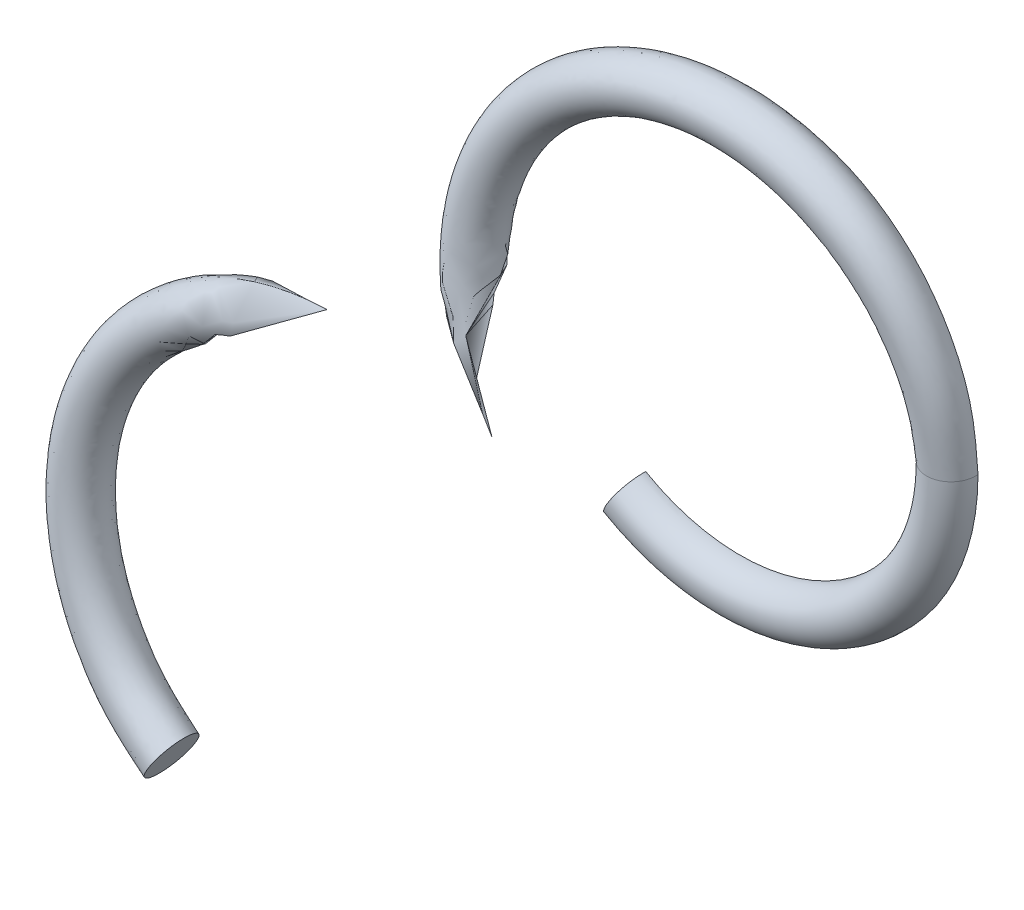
ISO-10303-21;
HEADER;
FILE_DESCRIPTION(('STEP AP214'),'2;1');
FILE_NAME('part.step','',(''),(''),'','','');
FILE_SCHEMA(('AUTOMOTIVE_DESIGN { 1 0 10303 214 1 1 1 1 }'));
ENDSEC;
DATA;
#1=APPLICATION_CONTEXT('core data for automotive mechanical design processes');
#2=APPLICATION_PROTOCOL_DEFINITION('international standard','automotive_design',2000,#1);
#3=PRODUCT_CONTEXT('',#1,'mechanical');
#4=PRODUCT('Part','Part','',(#3));
#5=PRODUCT_RELATED_PRODUCT_CATEGORY('part','',(#4));
#6=PRODUCT_DEFINITION_FORMATION('','',#4);
#7=PRODUCT_DEFINITION_CONTEXT('part definition',#1,'design');
#8=PRODUCT_DEFINITION('design','',#6,#7);
#9=PRODUCT_DEFINITION_SHAPE('','',#8);
#10=(LENGTH_UNIT() NAMED_UNIT(*) SI_UNIT(.MILLI.,.METRE.));
#11=(NAMED_UNIT(*) PLANE_ANGLE_UNIT() SI_UNIT($,.RADIAN.));
#12=(NAMED_UNIT(*) SI_UNIT($,.STERADIAN.) SOLID_ANGLE_UNIT());
#13=UNCERTAINTY_MEASURE_WITH_UNIT(LENGTH_MEASURE(1.E-05),#10,'distance_accuracy_value','');
#14=(GEOMETRIC_REPRESENTATION_CONTEXT(3) GLOBAL_UNCERTAINTY_ASSIGNED_CONTEXT((#13)) GLOBAL_UNIT_ASSIGNED_CONTEXT((#10,
#11,#12)) REPRESENTATION_CONTEXT('',''));
#15=CARTESIAN_POINT('',(0.,0.,0.));
#16=DIRECTION('',(0.,0.,1.));
#17=DIRECTION('',(1.,0.,0.));
#18=AXIS2_PLACEMENT_3D('',#15,#16,#17);
#19=CARTESIAN_POINT('',(6.5,0.,0.750000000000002));
#20=CARTESIAN_POINT('',(6.46667023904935,0.495477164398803,0.786397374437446));
#21=CARTESIAN_POINT('',(6.39990232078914,1.48804290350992,0.859310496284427));
#22=CARTESIAN_POINT('',(5.87725532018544,2.89977018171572,0.968737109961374));
#23=CARTESIAN_POINT('',(5.06972269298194,4.16005929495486,1.0781375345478));
#24=CARTESIAN_POINT('',(3.99080086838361,5.20136230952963,1.18750304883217));
#25=CARTESIAN_POINT('',(2.70641021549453,5.97284541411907,1.2968640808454));
#26=CARTESIAN_POINT('',(1.27901339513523,6.43029345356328,1.40625750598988));
#27=CARTESIAN_POINT('',(-0.214508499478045,6.55377214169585,1.51562753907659));
#28=CARTESIAN_POINT('',(-1.6969900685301,6.33312016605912,1.62498943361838));
#29=CARTESIAN_POINT('',(-3.09079331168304,5.78253553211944,1.73438816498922));
#30=CARTESIAN_POINT('',(-4.32341471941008,4.92989054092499,1.84373760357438));
#31=CARTESIAN_POINT('',(-5.32924682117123,3.81888146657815,1.95313457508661));
#32=CARTESIAN_POINT('',(-6.05827121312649,2.50944188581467,2.06249531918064));
#33=CARTESIAN_POINT('',(-6.46870000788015,1.0679537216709,2.1718735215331));
#34=CARTESIAN_POINT('',(-6.54309614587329,-0.428815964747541,2.28125730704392));
#35=CARTESIAN_POINT('',(-6.27437407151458,-1.90334131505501,2.39061354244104));
#36=CARTESIAN_POINT('',(-5.67816317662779,-3.27826248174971,2.50001279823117));
#37=CARTESIAN_POINT('',(-4.78590391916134,-4.48249235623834,2.60936381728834));
#38=CARTESIAN_POINT('',(-3.64242642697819,-5.4513005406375,2.71875701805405));
#39=CARTESIAN_POINT('',(-2.30987793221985,-6.13711001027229,2.82812395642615));
#40=CARTESIAN_POINT('',(-0.855741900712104,-6.50027459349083,2.93749478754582));
#41=CARTESIAN_POINT('',(0.642655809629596,-6.52539630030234,3.04688504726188));
#42=CARTESIAN_POINT('',(2.10766451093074,-6.20890610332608,3.1562373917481));
#43=CARTESIAN_POINT('',(3.46222312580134,-5.56773153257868,3.26563721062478));
#44=CARTESIAN_POINT('',(4.6367523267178,-4.636763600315,3.37499108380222));
#45=CARTESIAN_POINT('',(5.56755647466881,-3.46210137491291,3.48437854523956));
#46=CARTESIAN_POINT('',(6.20931024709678,-2.10781644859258,3.59375274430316));
#47=CARTESIAN_POINT('',(6.52492786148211,-0.642615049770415,3.70311659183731));
#48=CARTESIAN_POINT('',(6.50070030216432,0.855799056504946,3.81251190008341));
#49=CARTESIAN_POINT('',(6.13678363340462,2.30973872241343,3.92186229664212));
#50=CARTESIAN_POINT('',(5.45136760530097,3.64248568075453,4.03126059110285));
#51=CARTESIAN_POINT('',(4.48262085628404,4.78601807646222,4.14061912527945));
#52=CARTESIAN_POINT('',(3.27809446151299,5.67788794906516,4.24999974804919));
#53=CARTESIAN_POINT('',(1.90348900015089,6.27482179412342,4.35938126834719));
#54=CARTESIAN_POINT('',(0.428794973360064,6.54261943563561,4.46873915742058));
#55=CARTESIAN_POINT('',(-1.06801774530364,6.4690484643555,4.5781377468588));
#56=CARTESIAN_POINT('',(-2.50934223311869,6.05807106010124,4.6874882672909));
#57=CARTESIAN_POINT('',(-3.81886489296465,5.3292030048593,4.79688304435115));
#58=CARTESIAN_POINT('',(-4.93011682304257,4.32363419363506,4.9062476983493));
#59=CARTESIAN_POINT('',(-5.78217779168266,3.09059899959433,5.01562097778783));
#60=CARTESIAN_POINT('',(-6.33358759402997,1.69712152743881,5.12500922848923));
#61=CARTESIAN_POINT('',(-6.55331866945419,0.214507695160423,5.23436266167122));
#62=CARTESIAN_POINT('',(-6.43048687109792,-1.27908686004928,5.34376252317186));
#63=CARTESIAN_POINT('',(-5.97284025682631,-2.70625403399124,5.45311523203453));
#64=CARTESIAN_POINT('',(-5.20137334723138,-3.9911798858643,5.5625047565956));
#65=CARTESIAN_POINT('',(-4.15996975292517,-5.06888148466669,5.67187649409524));
#66=CARTESIAN_POINT('',(-2.89981138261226,-5.88031428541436,5.78124258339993));
#67=CARTESIAN_POINT('',(-1.48893999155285,-6.38555596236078,5.89063638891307));
#68=CARTESIAN_POINT('',(1.8596040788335E-05,-6.55700198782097,5.99998720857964));
#69=CARTESIAN_POINT('',(1.48878358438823,-6.38506734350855,6.1093862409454));
#70=CARTESIAN_POINT('',(2.90025603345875,-5.88117199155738,6.21874303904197));
#71=CARTESIAN_POINT('',(4.15924745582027,-5.0680122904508,6.32812602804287));
#72=CARTESIAN_POINT('',(5.20217761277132,-3.99182180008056,6.43750514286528));
#73=CARTESIAN_POINT('',(5.97218342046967,-2.70592578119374,6.54686487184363));
#74=CARTESIAN_POINT('',(6.43068427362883,-1.27917222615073,6.65626258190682));
#75=CARTESIAN_POINT('',(6.55365194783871,0.214554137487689,6.76561282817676));
#76=CARTESIAN_POINT('',(6.33284802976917,1.69688780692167,6.8750089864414));
#77=CARTESIAN_POINT('',(5.7831539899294,3.09113140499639,6.98437146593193));
#78=CARTESIAN_POINT('',(4.92925884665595,4.32288907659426,7.09374720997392));
#79=CARTESIAN_POINT('',(3.8193854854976,5.3298759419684,7.20313332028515));
#80=CARTESIAN_POINT('',(2.50914174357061,6.05767634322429,7.31248804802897));
#81=CARTESIAN_POINT('',(1.06804574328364,6.46893687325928,7.42188771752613));
#82=CARTESIAN_POINT('',(-0.428867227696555,6.54325795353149,7.53123947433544));
#83=CARTESIAN_POINT('',(-1.90318244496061,6.27389311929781,7.64063091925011));
#84=CARTESIAN_POINT('',(-3.27866457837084,5.67888083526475,7.75000022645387));
#85=CARTESIAN_POINT('',(-4.48193156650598,4.78525824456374,7.85936865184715));
#86=CARTESIAN_POINT('',(-5.45184840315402,3.64285435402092,7.96876076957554));
#87=CARTESIAN_POINT('',(-6.13669099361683,2.30966430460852,8.07811224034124));
#88=CARTESIAN_POINT('',(-6.50028421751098,0.855787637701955,8.18751178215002));
#89=CARTESIAN_POINT('',(-6.52581803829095,-0.642725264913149,8.29686702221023));
#90=CARTESIAN_POINT('',(-6.2082669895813,-2.10745048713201,8.4062522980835));
#91=CARTESIAN_POINT('',(-5.56847465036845,-3.46265413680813,8.51562896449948));
#92=CARTESIAN_POINT('',(-4.6361553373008,-4.63620234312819,8.62499068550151));
#93=CARTESIAN_POINT('',(-3.46242620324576,-5.56797426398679,8.73438729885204));
#94=CARTESIAN_POINT('',(-2.10770224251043,-6.2091306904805,8.84373750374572));
#95=CARTESIAN_POINT('',(-0.642624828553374,-6.5247032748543,8.9531348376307));
#96=CARTESIAN_POINT('',(0.855895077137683,-6.5013385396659,9.06249527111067));
#97=CARTESIAN_POINT('',(2.30947506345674,-6.13603549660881,9.17187347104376));
#98=CARTESIAN_POINT('',(3.64291348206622,-5.45207925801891,9.28125733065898));
#99=CARTESIAN_POINT('',(4.78552894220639,-4.48209669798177,9.39061354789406));
#100=CARTESIAN_POINT('',(5.67814022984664,-3.27830235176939,9.50001279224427));
#101=CARTESIAN_POINT('',(6.27490420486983,-1.90346818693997,9.60936381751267));
#102=CARTESIAN_POINT('',(6.5421779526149,-0.428783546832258,9.71875701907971));
#103=CARTESIAN_POINT('',(6.46983214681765,1.06814203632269,9.8281239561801));
#104=CARTESIAN_POINT('',(6.05727388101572,2.50904307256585,9.93749478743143));
#105=CARTESIAN_POINT('',(5.32983106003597,3.8192544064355,10.0468850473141));
#106=CARTESIAN_POINT('',(4.32323815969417,4.92974406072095,10.1562373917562));
#107=CARTESIAN_POINT('',(3.09068538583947,5.78223894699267,10.2656372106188));
#108=CARTESIAN_POINT('',(1.69717890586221,6.33392710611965,10.3749910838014));
#109=CARTESIAN_POINT('',(0.214489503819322,6.55269603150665,10.48437854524));
#110=CARTESIAN_POINT('',(-1.27923253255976,6.43132863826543,10.5937527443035));
#111=CARTESIAN_POINT('',(-2.70594297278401,5.97206081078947,10.7031165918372));
#112=CARTESIAN_POINT('',(-3.99149387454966,5.20187207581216,10.8125119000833));
#113=CARTESIAN_POINT('',(-5.06868422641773,4.15974116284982,10.9218622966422));
#114=CARTESIAN_POINT('',(-5.88016893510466,2.89977999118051,11.0312605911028));
#115=CARTESIAN_POINT('',(-6.38612366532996,1.48905449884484,11.1406191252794));
#116=CARTESIAN_POINT('',(-6.55624243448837,-3.08948574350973E-05,11.2499997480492));
#117=CARTESIAN_POINT('',(-6.38589957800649,-1.48894106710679,11.3593812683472));
#118=CARTESIAN_POINT('',(-5.88047212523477,-2.89996237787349,11.4687391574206));
#119=CARTESIAN_POINT('',(-5.06835143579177,-4.15945473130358,11.5781377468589));
#120=CARTESIAN_POINT('',(-3.99177231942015,-5.20218965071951,11.6874882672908));
#121=CARTESIAN_POINT('',(-2.70579273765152,-5.97183551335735,11.796883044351));
#122=CARTESIAN_POINT('',(-1.27931863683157,-6.43142350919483,11.9062476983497));
#123=CARTESIAN_POINT('',(0.214551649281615,-6.55281235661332,12.0156209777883));
#124=CARTESIAN_POINT('',(1.69704344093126,-6.33360851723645,12.1250092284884));
#125=CARTESIAN_POINT('',(3.09089022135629,-5.78259429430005,12.2343626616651));
#126=CARTESIAN_POINT('',(4.32296515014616,-4.929421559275,12.34376252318));
#127=CARTESIAN_POINT('',(5.33010487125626,-3.81950437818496,12.4531152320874));
#128=CARTESIAN_POINT('',(6.05714984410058,-2.50893150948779,12.5625047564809));
#129=CARTESIAN_POINT('',(6.46976501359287,-1.06819874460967,12.6718764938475));
#130=CARTESIAN_POINT('',(6.54240724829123,0.428846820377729,12.7812425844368));
#131=CARTESIAN_POINT('',(6.27452365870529,1.90331812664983,12.8906363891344));
#132=CARTESIAN_POINT('',(5.67852102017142,3.27851709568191,12.9999872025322));
#133=CARTESIAN_POINT('',(4.78523878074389,4.48185809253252,13.1093862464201));
#134=CARTESIAN_POINT('',(3.64311611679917,5.45228123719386,13.2187430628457));
#135=CARTESIAN_POINT('',(2.30940373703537,6.13602023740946,13.3281259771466));
#136=CARTESIAN_POINT('',(0.855930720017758,6.50112994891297,13.4375050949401));
#137=CARTESIAN_POINT('',(-0.642691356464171,6.52502275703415,13.5468651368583));
#138=CARTESIAN_POINT('',(-2.10754660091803,6.20872134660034,13.6562624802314));
#139=CARTESIAN_POINT('',(-3.4626420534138,5.56836457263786,13.7656119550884));
#140=CARTESIAN_POINT('',(-4.63596294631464,4.63595341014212,13.8750102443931));
#141=CARTESIAN_POINT('',(-5.56853312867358,3.46276323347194,13.9843728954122));
#142=CARTESIAN_POINT('',(-6.20845407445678,2.10748139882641,14.0937419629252));
#143=CARTESIAN_POINT('',(-6.52558491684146,0.642629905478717,14.2031363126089));
#144=CARTESIAN_POINT('',(-6.50010496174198,-0.855500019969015,14.3124968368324));
#145=CARTESIAN_POINT('',(-6.13727255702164,-2.31036581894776,14.421862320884));
#146=CARTESIAN_POINT('',(-5.45041269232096,-3.64026523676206,14.5312631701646));
#147=CARTESIAN_POINT('',(-4.48833887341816,-4.7981984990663,14.6406890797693));
#148=CARTESIAN_POINT('',(-3.66228782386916,-5.35240051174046,14.7136025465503));
#149=CARTESIAN_POINT('',(-3.2499340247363,-5.62905085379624,14.749999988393));
#150=CARTESIAN_POINT('',(8.,0.,0.750000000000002));
#151=CARTESIAN_POINT('',(7.95914409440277,0.609634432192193,0.786309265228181));
#152=CARTESIAN_POINT('',(7.8772994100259,1.83088597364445,0.859045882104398));
#153=CARTESIAN_POINT('',(7.23328216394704,3.56928928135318,0.969463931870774));
#154=CARTESIAN_POINT('',(6.24028324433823,5.11941974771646,1.07793988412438));
#155=CARTESIAN_POINT('',(4.9104467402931,6.40289406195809,1.18783369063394));
#156=CARTESIAN_POINT('',(3.33252149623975,7.35029348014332,1.29674316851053));
#157=CARTESIAN_POINT('',(1.57380913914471,7.91469948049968,1.40652945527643));
#158=CARTESIAN_POINT('',(-0.264780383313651,8.06592220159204,1.51586290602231));
#159=CARTESIAN_POINT('',(-2.08729154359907,7.79522697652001,1.62481645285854));
#160=CARTESIAN_POINT('',(-3.80581532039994,7.11605832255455,1.73496930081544));
#161=CARTESIAN_POINT('',(-5.31957898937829,6.068854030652,1.84342715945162));
#162=CARTESIAN_POINT('',(-6.56018890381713,4.69912382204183,1.95359286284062));
#163=CARTESIAN_POINT('',(-7.45574209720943,3.08931659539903,2.06242504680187));
#164=CARTESIAN_POINT('',(-7.96183760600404,1.31466674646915,2.17196591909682));
#165=CARTESIAN_POINT('',(-8.05279176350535,-0.529052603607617,2.28167083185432));
#166=CARTESIAN_POINT('',(-7.72297416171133,-2.34095535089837,2.39036780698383));
#167=CARTESIAN_POINT('',(-6.98760563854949,-4.03658140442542,2.50058507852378));
#168=CARTESIAN_POINT('',(-5.891540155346,-5.51544967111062,2.60908548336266));
#169=CARTESIAN_POINT('',(-4.48230710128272,-6.71018216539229,2.71912367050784));
#170=CARTESIAN_POINT('',(-2.84308324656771,-7.55303168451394,2.82819869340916));
#171=CARTESIAN_POINT('',(-1.054003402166,-8.00059320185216,2.93746830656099));
#172=CARTESIAN_POINT('',(0.792638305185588,-8.03100022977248,3.04738719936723));
#173=CARTESIAN_POINT('',(2.59221759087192,-7.64243384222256,3.15594382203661));
#174=CARTESIAN_POINT('',(4.26290124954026,-6.85177223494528,3.26618208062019));
#175=CARTESIAN_POINT('',(5.70551184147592,-5.70776767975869,3.37477845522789));
#176=CARTESIAN_POINT('',(6.85299675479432,-4.26081068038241,3.48462963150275));
#177=CARTESIAN_POINT('',(7.64216901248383,-2.59368195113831,3.5939949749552));
#178=CARTESIAN_POINT('',(8.03083896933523,-0.79218075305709,3.70297927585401));
#179=CARTESIAN_POINT('',(8.00060567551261,1.05521230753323,3.81306806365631));
#180=CARTESIAN_POINT('',(7.55366711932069,2.84084680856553,3.9215521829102));
#181=CARTESIAN_POINT('',(6.70871203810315,4.48455615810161,4.03174778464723));
#182=CARTESIAN_POINT('',(5.5177294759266,5.88953579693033,4.14050599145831));
#183=CARTESIAN_POINT('',(4.03479566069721,6.98851176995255,4.25013169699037));
#184=CARTESIAN_POINT('',(2.34162660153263,7.7230057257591,4.35975829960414));
#185=CARTESIAN_POINT('',(0.529397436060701,8.05254552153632,4.46851586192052));
#186=CARTESIAN_POINT('',(-1.31648728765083,7.96166280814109,4.57871175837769));
#187=CARTESIAN_POINT('',(-3.08658041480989,7.45674106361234,4.68719600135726));
#188=CARTESIAN_POINT('',(-4.70133137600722,6.55858948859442,4.79728425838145));
#189=CARTESIAN_POINT('',(-6.06730608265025,5.32160718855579,4.90626936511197));
#190=CARTESIAN_POINT('',(-7.11659055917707,3.80448681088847,5.01563378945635));
#191=CARTESIAN_POINT('',(-7.79547932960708,2.08721030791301,5.12548575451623));
#192=CARTESIAN_POINT('',(-8.06566889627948,0.265914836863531,5.23408168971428));
#193=CARTESIAN_POINT('',(-7.9142387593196,-1.57619606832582,5.34431999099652));
#194=CARTESIAN_POINT('',(-7.35173041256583,-3.3291503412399,5.45287697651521));
#195=CARTESIAN_POINT('',(-6.40156939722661,-4.91302207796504,5.56279513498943));
#196=CARTESIAN_POINT('',(-5.11960526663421,-6.2386001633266,5.67206566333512));
#197=CARTESIAN_POINT('',(-3.57011311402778,-7.23710388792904,5.7811398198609));
#198=CARTESIAN_POINT('',(-1.83070756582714,-7.85953944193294,5.89117859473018));
#199=CARTESIAN_POINT('',(-0.0020031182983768,-8.07017183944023,5.99967890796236));
#200=CARTESIAN_POINT('',(1.83407916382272,-7.85840344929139,6.10989591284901));
#201=CARTESIAN_POINT('',(3.56827979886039,-7.23873320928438,6.21859290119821));
#202=CARTESIAN_POINT('',(5.11945988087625,-6.23776412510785,6.3282978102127));
#203=CARTESIAN_POINT('',(6.4030878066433,-4.91214447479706,6.43784124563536));
#204=CARTESIAN_POINT('',(7.34995789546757,-3.33185170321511,6.54666720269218));
#205=CARTESIAN_POINT('',(7.91513579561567,-1.57240700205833,6.65683457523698));
#206=CARTESIAN_POINT('',(8.06602566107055,0.262068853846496,6.76531065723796));
#207=CARTESIAN_POINT('',(7.79423487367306,2.08987783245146,6.87544186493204));
#208=CARTESIAN_POINT('',(7.11784709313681,3.80370151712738,6.98434417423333));
#209=CARTESIAN_POINT('',(6.0673237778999,5.32044744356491,7.09379958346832));
#210=CARTESIAN_POINT('',(4.69952519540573,6.56057257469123,7.20358049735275));
#211=CARTESIAN_POINT('',(3.08991859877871,7.45502949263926,7.31222302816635));
#212=CARTESIAN_POINT('',(1.31258688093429,7.96223523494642,7.42245434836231));
#213=CARTESIAN_POINT('',(-0.526026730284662,8.05320621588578,7.53097924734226));
#214=CARTESIAN_POINT('',(-2.34333735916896,7.72181891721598,7.6409602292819));
#215=CARTESIAN_POINT('',(-4.0351518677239,6.98917340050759,7.75013217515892));
#216=CARTESIAN_POINT('',(-5.51577938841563,5.89042072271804,7.85930323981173));
#217=CARTESIAN_POINT('',(-6.7109118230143,4.48198670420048,7.96928489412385));
#218=CARTESIAN_POINT('',(-7.55218891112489,2.8445530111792,8.07780950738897));
#219=CARTESIAN_POINT('',(-8.00081340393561,1.05151657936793,8.18804070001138));
#220=CARTESIAN_POINT('',(-8.03170421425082,-0.789581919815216,8.29668374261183));
#221=CARTESIAN_POINT('',(-7.64121712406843,-2.59424450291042,8.40646382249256));
#222=CARTESIAN_POINT('',(-6.85293465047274,-4.26223176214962,8.51592015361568));
#223=CARTESIAN_POINT('',(-5.70720260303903,-5.70529090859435,8.62482170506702));
#224=CARTESIAN_POINT('',(-4.25977827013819,-6.85396091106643,8.7349533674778));
#225=CARTESIAN_POINT('',(-2.59599744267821,-7.64131457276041,8.84342940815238));
#226=CARTESIAN_POINT('',(-0.789464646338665,-8.03085197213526,8.95359640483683));
#227=CARTESIAN_POINT('',(1.05244469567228,-8.00152097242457,9.06242306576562));
#228=CARTESIAN_POINT('',(2.84238391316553,-7.55248719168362,9.17196558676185));
#229=CARTESIAN_POINT('',(4.48456883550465,-6.70939565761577,9.28167136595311));
#230=CARTESIAN_POINT('',(5.88881382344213,-5.51781418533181,9.39036777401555));
#231=CARTESIAN_POINT('',(6.98958491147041,-4.0331533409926,9.50058499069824));
#232=CARTESIAN_POINT('',(7.72228960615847,-2.34449856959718,9.60908550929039));
#233=CARTESIAN_POINT('',(8.05234175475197,-0.526700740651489,9.71912368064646));
#234=CARTESIAN_POINT('',(7.96265894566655,1.31433351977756,9.82819868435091));
#235=CARTESIAN_POINT('',(7.45571865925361,3.08750288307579,9.93746830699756));
#236=CARTESIAN_POINT('',(6.5587310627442,4.70194502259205,10.0473872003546));
#237=CARTESIAN_POINT('',(5.3224330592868,6.06614320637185,10.1559438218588));
#238=CARTESIAN_POINT('',(3.8023581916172,7.11766689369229,10.2661820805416));
#239=CARTESIAN_POINT('',(2.09031588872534,7.79500203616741,10.374778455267));
#240=CARTESIAN_POINT('',(0.263471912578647,8.06527462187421,10.4846296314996));
#241=CARTESIAN_POINT('',(-1.57489004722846,7.91515348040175,10.5939949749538));
#242=CARTESIAN_POINT('',(-3.32937082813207,7.35100093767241,10.7029792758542));
#243=CARTESIAN_POINT('',(-4.91414350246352,6.40112160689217,10.8130680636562));
#244=CARTESIAN_POINT('',(-6.23707906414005,5.12124421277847,10.9215521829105));
#245=CARTESIAN_POINT('',(-7.23809557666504,3.56763697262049,11.031747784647));
#246=CARTESIAN_POINT('',(-7.85935235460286,1.83372599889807,11.1405059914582));
#247=CARTESIAN_POINT('',(-8.06962655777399,-2.03437339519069E-05,11.2501316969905));
#248=CARTESIAN_POINT('',(-7.85913245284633,-1.83359473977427,11.3597582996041));
#249=CARTESIAN_POINT('',(-7.23840770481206,-3.56780113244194,11.4685158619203));
#250=CARTESIAN_POINT('',(-6.23675860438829,-5.12094283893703,11.5787117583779));
#251=CARTESIAN_POINT('',(-4.91443698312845,-6.40142758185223,11.6871960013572));
#252=CARTESIAN_POINT('',(-3.3292394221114,-7.35076714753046,11.7972842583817));
#253=CARTESIAN_POINT('',(-1.57499397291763,-7.91524479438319,11.9062693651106));
#254=CARTESIAN_POINT('',(0.263513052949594,-8.06539161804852,12.0156337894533));
#255=CARTESIAN_POINT('',(2.09016251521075,-7.79468828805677,12.1254857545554));
#256=CARTESIAN_POINT('',(3.80254544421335,-7.11803158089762,12.2340816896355));
#257=CARTESIAN_POINT('',(5.32214521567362,-6.06583378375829,12.3443199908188));
#258=CARTESIAN_POINT('',(6.55899397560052,-4.70221012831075,12.4528769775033));
#259=CARTESIAN_POINT('',(7.45558662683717,-3.08741067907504,12.5627951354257));
#260=CARTESIAN_POINT('',(7.96258885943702,-1.31440814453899,12.6720656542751));
#261=CARTESIAN_POINT('',(8.0525723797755,0.52674328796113,12.7811398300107));
#262=CARTESIAN_POINT('',(7.72191457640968,2.34433049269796,12.8911786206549));
#263=CARTESIAN_POINT('',(6.98997540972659,4.03335115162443,12.9996788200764));
#264=CARTESIAN_POINT('',(5.88853752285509,5.51756086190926,13.109895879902));
#265=CARTESIAN_POINT('',(4.4847866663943,6.70958743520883,13.218593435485));
#266=CARTESIAN_POINT('',(2.84233253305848,7.55246441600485,13.3282974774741));
#267=CARTESIAN_POINT('',(1.05249803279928,8.00131023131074,13.4378392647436));
#268=CARTESIAN_POINT('',(-0.789512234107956,8.03117300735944,13.5466707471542));
#269=CARTESIAN_POINT('',(-2.59581757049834,7.64091289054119,13.6568368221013));
#270=CARTESIAN_POINT('',(-4.25997938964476,6.8543632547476,13.7652947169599));
#271=CARTESIAN_POINT('',(-5.70701937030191,5.70503234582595,13.8754471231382));
#272=CARTESIAN_POINT('',(-6.85294791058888,4.26239043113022,13.9844014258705));
#273=CARTESIAN_POINT('',(-7.64137846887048,2.59440386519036,14.0937339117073));
#274=CARTESIAN_POINT('',(-8.03154385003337,0.789143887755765,14.2035211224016));
#275=CARTESIAN_POINT('',(-8.00048740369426,-1.05115110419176,14.3124300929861));
#276=CARTESIAN_POINT('',(-7.55339045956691,-2.84440205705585,14.4223238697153));
#277=CARTESIAN_POINT('',(-6.70825699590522,-4.47984398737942,14.5308002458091));
#278=CARTESIAN_POINT('',(-5.52396342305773,-5.90622606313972,14.6412175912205));
#279=CARTESIAN_POINT('',(-4.50740391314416,-6.58783102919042,14.7139545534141));
#280=CARTESIAN_POINT('',(-3.99995080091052,-6.92807924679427,14.7502638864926));
#281=CARTESIAN_POINT('',(8.,0.,-0.750000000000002));
#282=CARTESIAN_POINT('',(7.95906423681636,0.60960049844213,-0.713690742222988));
#283=CARTESIAN_POINT('',(7.87705957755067,1.83078406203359,-0.640954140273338));
#284=CARTESIAN_POINT('',(7.23391292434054,3.56964526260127,-0.53053597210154));
#285=CARTESIAN_POINT('',(6.2401361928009,5.11929407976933,-0.422060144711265));
#286=CARTESIAN_POINT('',(4.91066546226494,6.40314300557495,-0.312166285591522));
#287=CARTESIAN_POINT('',(3.33241985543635,7.35020839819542,-0.203256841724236));
#288=CARTESIAN_POINT('',(1.5739232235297,7.91495494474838,-0.0934705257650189));
#289=CARTESIAN_POINT('',(-0.264856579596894,8.06615583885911,0.0158629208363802));
#290=CARTESIAN_POINT('',(-2.08720362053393,7.795074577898,0.124816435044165));
#291=CARTESIAN_POINT('',(-3.80611089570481,7.11655787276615,0.234969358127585));
#292=CARTESIAN_POINT('',(-5.31938972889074,6.06861203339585,0.343427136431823));
#293=CARTESIAN_POINT('',(-6.56053825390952,4.69942145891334,0.45359289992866));
#294=CARTESIAN_POINT('',(-7.45570485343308,3.08922761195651,0.562425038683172));
#295=CARTESIAN_POINT('',(-7.96191908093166,1.31474914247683,0.671965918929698));
#296=CARTESIAN_POINT('',(-8.05320048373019,-0.529141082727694,0.781670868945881));
#297=CARTESIAN_POINT('',(-7.72275027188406,-2.34085914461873,0.890367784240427));
#298=CARTESIAN_POINT('',(-6.98809752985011,-4.0368709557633,1.00058513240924));
#299=CARTESIAN_POINT('',(-5.89131482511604,-5.51528790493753,1.1090854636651));
#300=CARTESIAN_POINT('',(-4.48255493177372,-6.71045712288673,1.21912369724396));
#301=CARTESIAN_POINT('',(-2.84304171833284,-7.55312856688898,1.32819869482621));
#302=CARTESIAN_POINT('',(-1.05406143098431,-8.00056101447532,1.43746829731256));
#303=CARTESIAN_POINT('',(0.792735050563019,-8.03149476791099,1.54738724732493));
#304=CARTESIAN_POINT('',(2.59211637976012,-7.64216214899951,1.6559437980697));
#305=CARTESIAN_POINT('',(4.26317592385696,-6.85224143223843,1.76618212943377));
#306=CARTESIAN_POINT('',(5.70540054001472,-5.7075819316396,1.87477843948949));
#307=CARTESIAN_POINT('',(6.8531762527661,-4.26099839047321,1.9846296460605));
#308=CARTESIAN_POINT('',(7.64242230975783,-2.59369187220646,2.09399499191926));
#309=CARTESIAN_POINT('',(8.030700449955,-0.792216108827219,2.20297925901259));
#310=CARTESIAN_POINT('',(8.00115196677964,1.05531470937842,2.31306811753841));
#311=CARTESIAN_POINT('',(7.55337660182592,2.84074913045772,2.42155215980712));
#312=CARTESIAN_POINT('',(6.70913430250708,4.48479912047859,2.53174782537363));
#313=CARTESIAN_POINT('',(5.51760612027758,5.88949905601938,2.64050598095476));
#314=CARTESIAN_POINT('',(4.03492156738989,6.98859279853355,2.75013170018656));
#315=CARTESIAN_POINT('',(2.34167382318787,7.72338570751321,2.85975833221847));
#316=CARTESIAN_POINT('',(0.529415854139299,8.05232399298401,2.968515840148));
#317=CARTESIAN_POINT('',(-1.3165916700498,7.96222584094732,3.0787118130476));
#318=CARTESIAN_POINT('',(-3.08649750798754,7.45646283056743,3.18719598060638));
#319=CARTESIAN_POINT('',(-4.70152527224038,6.55894341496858,3.2972842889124));
#320=CARTESIAN_POINT('',(-6.06737091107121,5.32156836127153,3.4062693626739));
#321=CARTESIAN_POINT('',(-7.11657301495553,3.80455081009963,3.51563378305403));
#322=CARTESIAN_POINT('',(-7.79595303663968,2.08728245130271,3.62548579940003));
#323=CARTESIAN_POINT('',(-8.06539129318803,0.26592060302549,3.73408166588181));
#324=CARTESIAN_POINT('',(-7.91478569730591,-1.57629653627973,3.84432004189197));
#325=CARTESIAN_POINT('',(-7.35149634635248,-3.32909644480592,3.95287695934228));
#326=CARTESIAN_POINT('',(-6.40183743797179,-4.91315009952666,4.06279515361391));
#327=CARTESIAN_POINT('',(-5.11966943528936,-6.23879348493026,4.17206567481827));
#328=CARTESIAN_POINT('',(-3.57011682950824,-7.23699047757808,4.28113980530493));
#329=CARTESIAN_POINT('',(-1.83079511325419,-7.86007476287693,4.39117864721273));
#330=CARTESIAN_POINT('',(-0.0019986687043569,-8.06986737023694,4.49967888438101));
#331=CARTESIAN_POINT('',(1.83416855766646,-7.85890469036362,4.60989595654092));
#332=CARTESIAN_POINT('',(3.56826940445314,-7.23857336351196,4.71859288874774));
#333=CARTESIAN_POINT('',(5.11951683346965,-6.23794083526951,4.8282978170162));
#334=CARTESIAN_POINT('',(6.40339625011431,-4.91229539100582,4.93784127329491));
#335=CARTESIAN_POINT('',(7.34976499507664,-3.33180649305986,5.0466671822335));
#336=CARTESIAN_POINT('',(7.91569884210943,-1.5725009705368,5.15683463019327));
#337=CARTESIAN_POINT('',(8.06572651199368,0.262082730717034,5.26531063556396));
#338=CARTESIAN_POINT('',(7.79466349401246,2.08994765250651,5.37544189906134));
#339=CARTESIAN_POINT('',(7.11779136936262,3.80375135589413,5.48434416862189));
#340=CARTESIAN_POINT('',(6.06740845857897,5.32043280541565,5.5937995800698));
#341=CARTESIAN_POINT('',(4.6997388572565,6.56096950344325,5.70358053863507));
#342=CARTESIAN_POINT('',(3.089838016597,7.454779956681,5.81222300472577));
#343=CARTESIAN_POINT('',(1.31268061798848,7.9627925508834,5.92245440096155));
#344=CARTESIAN_POINT('',(-0.526051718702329,8.05294685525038,6.03097922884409));
#345=CARTESIAN_POINT('',(-2.34337767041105,7.72215074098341,6.14096025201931));
#346=CARTESIAN_POINT('',(-4.035281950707,6.98925197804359,6.25013218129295));
#347=CARTESIAN_POINT('',(-5.5156940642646,5.89041433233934,6.35930322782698));
#348=CARTESIAN_POINT('',(-6.7113704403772,4.48224237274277,6.469284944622));
#349=CARTESIAN_POINT('',(-7.55190842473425,2.8444496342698,6.57780948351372));
#350=CARTESIAN_POINT('',(-8.00133379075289,1.05160599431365,6.68804074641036));
#351=CARTESIAN_POINT('',(-8.03151856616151,-0.789621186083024,6.79668372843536));
#352=CARTESIAN_POINT('',(-7.64143956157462,-2.59424949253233,6.90646383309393));
#353=CARTESIAN_POINT('',(-6.8531453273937,-4.26244561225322,7.01592017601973));
#354=CARTESIAN_POINT('',(-5.70711625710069,-5.70514271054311,7.12482168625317));
#355=CARTESIAN_POINT('',(-4.26005610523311,-6.854453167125,7.23495342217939));
#356=CARTESIAN_POINT('',(-2.5958832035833,-7.64103194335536,7.34342938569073));
#357=CARTESIAN_POINT('',(-0.789547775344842,-8.03130661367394,7.45359644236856));
#358=CARTESIAN_POINT('',(1.05250280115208,-8.00144232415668,7.56242305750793));
#359=CARTESIAN_POINT('',(2.8423531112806,-7.55259871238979,7.67196558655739));
#360=CARTESIAN_POINT('',(4.48485014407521,-6.70970578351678,7.78167140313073));
#361=CARTESIAN_POINT('',(5.88861853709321,-5.5176683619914,7.89036775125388));
#362=CARTESIAN_POINT('',(6.99008154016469,-4.03343452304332,8.00058504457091));
#363=CARTESIAN_POINT('',(7.7220368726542,-2.34438431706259,8.10908548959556));
#364=CARTESIAN_POINT('',(8.05270379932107,-0.526777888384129,8.21912370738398));
#365=CARTESIAN_POINT('',(7.96272207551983,1.31441792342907,8.32819868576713));
#366=CARTESIAN_POINT('',(7.45571979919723,3.08743653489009,8.43746829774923));
#367=CARTESIAN_POINT('',(6.55911097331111,4.70227607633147,8.54738724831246));
#368=CARTESIAN_POINT('',(5.32224837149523,6.06591970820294,8.65594379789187));
#369=CARTESIAN_POINT('',(3.80262719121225,7.11813936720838,8.76618212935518));
#370=CARTESIAN_POINT('',(2.09021067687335,7.79481277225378,8.87477843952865));
#371=CARTESIAN_POINT('',(0.263544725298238,8.06552392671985,8.9846296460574));
#372=CARTESIAN_POINT('',(-1.57500810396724,7.91537780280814,9.09399499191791));
#373=CARTESIAN_POINT('',(-3.32927094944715,7.35089865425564,9.20297925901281));
#374=CARTESIAN_POINT('',(-4.91450533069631,6.40154350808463,9.31306811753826));
#375=CARTESIAN_POINT('',(-6.23684921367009,5.12104145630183,9.42155215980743));
#376=CARTESIAN_POINT('',(-7.2385171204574,3.5678811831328,9.53174782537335));
#377=CARTESIAN_POINT('',(-7.85925885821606,1.83363754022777,9.64050598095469));
#378=CARTESIAN_POINT('',(-8.06975968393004,4.81803699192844E-05,9.75013170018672));
#379=CARTESIAN_POINT('',(-7.85948513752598,-1.83374383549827,9.85975833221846));
#380=CARTESIAN_POINT('',(-7.23822506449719,-3.56767441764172,9.96851584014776));
#381=CARTESIAN_POINT('',(-6.2371940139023,-5.1213147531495,10.0787118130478));
#382=CARTESIAN_POINT('',(-4.91423747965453,-6.40121666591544,10.1871959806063));
#383=CARTESIAN_POINT('',(-3.3294489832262,-7.3511120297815,10.2972842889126));
#384=CARTESIAN_POINT('',(-1.57492793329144,-7.9152815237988,10.4062693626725));
#385=CARTESIAN_POINT('',(0.26344885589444,-8.06540842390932,10.5156337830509));
#386=CARTESIAN_POINT('',(2.09033689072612,-7.79513460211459,10.6254857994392));
#387=CARTESIAN_POINT('',(3.80240164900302,-7.11779405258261,10.7340816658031));
#388=CARTESIAN_POINT('',(5.32250569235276,-6.06625721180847,10.8443200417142));
#389=CARTESIAN_POINT('',(6.55883026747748,-4.70203436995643,10.9528769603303));
#390=CARTESIAN_POINT('',(7.45583151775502,-3.08757879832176,11.0627951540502));
#391=CARTESIAN_POINT('',(7.96278835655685,-1.31436705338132,11.1720656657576));
#392=CARTESIAN_POINT('',(8.05247603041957,0.526683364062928,11.2811398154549));
#393=CARTESIAN_POINT('',(7.7224219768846,2.34452234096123,11.3911786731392));
#394=CARTESIAN_POINT('',(6.98970943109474,4.03320273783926,11.4996787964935));
#395=CARTESIAN_POINT('',(5.88892688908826,5.517888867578,11.6098959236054));
#396=CARTESIAN_POINT('',(4.48465375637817,6.70949891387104,11.7185934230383));
#397=CARTESIAN_POINT('',(2.84245690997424,7.55260185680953,11.8282974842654));
#398=CARTESIAN_POINT('',(1.05247417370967,8.00165090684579,11.9378392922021));
#399=CARTESIAN_POINT('',(-0.789454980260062,8.03098662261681,12.0466707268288));
#400=CARTESIAN_POINT('',(-2.596018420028,7.64144976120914,12.1568368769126));
#401=CARTESIAN_POINT('',(-4.25983483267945,6.85408375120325,12.2652946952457));
#402=CARTESIAN_POINT('',(-5.70729582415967,5.7053727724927,12.3754471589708));
#403=CARTESIAN_POINT('',(-6.85300964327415,4.26234830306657,12.48440142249));
#404=CARTESIAN_POINT('',(-7.64135228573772,2.59446059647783,12.5937339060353));
#405=CARTESIAN_POINT('',(-8.03193330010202,0.789124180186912,12.7035211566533));
#406=CARTESIAN_POINT('',(-8.00042641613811,-1.05112058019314,12.8124300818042));
#407=CARTESIAN_POINT('',(-7.55382195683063,-2.84456052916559,12.9223238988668));
#408=CARTESIAN_POINT('',(-6.70785462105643,-4.47962343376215,13.0308002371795));
#409=CARTESIAN_POINT('',(-5.52435379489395,-5.90657774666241,13.1412176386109));
#410=CARTESIAN_POINT('',(-4.50762191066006,-6.58810057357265,13.2139545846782));
#411=CARTESIAN_POINT('',(-4.00008275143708,-6.92830778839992,13.2502639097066));
#412=CARTESIAN_POINT('',(6.5,0.,-0.750000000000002));
#413=CARTESIAN_POINT('',(6.46659038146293,0.49544323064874,-0.713602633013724));
#414=CARTESIAN_POINT('',(6.39966248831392,1.48794099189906,-0.640689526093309));
#415=CARTESIAN_POINT('',(5.87788608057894,2.90012616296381,-0.531262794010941));
#416=CARTESIAN_POINT('',(5.06957564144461,4.15993362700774,-0.421862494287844));
#417=CARTESIAN_POINT('',(3.99101959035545,5.20161125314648,-0.312496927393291));
#418=CARTESIAN_POINT('',(2.70630857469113,5.97276033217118,-0.20313592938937));
#419=CARTESIAN_POINT('',(1.27912747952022,6.43054891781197,-0.0937424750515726));
#420=CARTESIAN_POINT('',(-0.214584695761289,6.55400577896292,0.0156275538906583));
#421=CARTESIAN_POINT('',(-1.69690214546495,6.33296776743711,0.124989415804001));
#422=CARTESIAN_POINT('',(-3.09108888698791,5.78303508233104,0.23438822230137));
#423=CARTESIAN_POINT('',(-4.32322545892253,4.92964854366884,0.343737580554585));
#424=CARTESIAN_POINT('',(-5.32959617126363,3.81917910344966,0.453134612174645));
#425=CARTESIAN_POINT('',(-6.05823396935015,2.50935290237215,0.56249531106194));
#426=CARTESIAN_POINT('',(-6.46878148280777,1.06803611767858,0.671873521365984));
#427=CARTESIAN_POINT('',(-6.54350486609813,-0.428904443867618,0.78125734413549));
#428=CARTESIAN_POINT('',(-6.27415018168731,-1.90324510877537,0.890613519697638));
#429=CARTESIAN_POINT('',(-5.67865506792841,-3.27855203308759,1.00001285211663));
#430=CARTESIAN_POINT('',(-4.78567858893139,-4.48233059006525,1.10936379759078));
#431=CARTESIAN_POINT('',(-3.6426742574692,-5.45157549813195,1.21875704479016));
#432=CARTESIAN_POINT('',(-2.30983640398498,-6.13720689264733,1.3281239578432));
#433=CARTESIAN_POINT('',(-0.855799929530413,-6.500242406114,1.43749477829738));
#434=CARTESIAN_POINT('',(0.642752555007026,-6.52589083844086,1.54688509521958));
#435=CARTESIAN_POINT('',(2.10756329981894,-6.20863441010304,1.65623736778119));
#436=CARTESIAN_POINT('',(3.46249780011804,-5.56820072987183,1.76563725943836));
#437=CARTESIAN_POINT('',(4.6366410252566,-4.63657785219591,1.87499106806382));
#438=CARTESIAN_POINT('',(5.56773597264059,-3.46228908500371,1.98437855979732));
#439=CARTESIAN_POINT('',(6.20956354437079,-2.10782636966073,2.09375276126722));
#440=CARTESIAN_POINT('',(6.52478934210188,-0.642650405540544,2.2031165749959));
#441=CARTESIAN_POINT('',(6.50124659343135,0.855901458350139,2.31251195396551));
#442=CARTESIAN_POINT('',(6.13649311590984,2.30964104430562,2.42186227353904));
#443=CARTESIAN_POINT('',(5.4517898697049,3.64272864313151,2.53126063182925));
#444=CARTESIAN_POINT('',(4.48249750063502,4.78598133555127,2.64061911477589));
#445=CARTESIAN_POINT('',(3.27822036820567,5.67796897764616,2.74999975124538));
#446=CARTESIAN_POINT('',(1.90353622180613,6.27520177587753,2.85938130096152));
#447=CARTESIAN_POINT('',(0.428813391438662,6.5423979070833,2.96873913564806));
#448=CARTESIAN_POINT('',(-1.06812212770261,6.46961149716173,3.07813780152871));
#449=CARTESIAN_POINT('',(-2.50925932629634,6.05779282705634,3.18748824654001));
#450=CARTESIAN_POINT('',(-3.8190587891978,5.32955693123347,3.29688307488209));
#451=CARTESIAN_POINT('',(-4.93018165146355,4.3235953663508,3.40624769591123));
#452=CARTESIAN_POINT('',(-5.78216024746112,3.09066299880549,3.5156209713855));
#453=CARTESIAN_POINT('',(-6.33406130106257,1.6971936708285,3.62500927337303));
#454=CARTESIAN_POINT('',(-6.55304106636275,0.214513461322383,3.73436263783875));
#455=CARTESIAN_POINT('',(-6.43103380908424,-1.27918732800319,3.84376257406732));
#456=CARTESIAN_POINT('',(-5.97260619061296,-2.70620013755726,3.9531152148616));
#457=CARTESIAN_POINT('',(-5.20164138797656,-3.99130790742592,4.06250477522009));
#458=CARTESIAN_POINT('',(-4.16003392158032,-5.06907480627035,4.17187650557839));
#459=CARTESIAN_POINT('',(-2.89981509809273,-5.88020087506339,4.28124256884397));
#460=CARTESIAN_POINT('',(-1.4890275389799,-6.38609128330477,4.39063644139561));
#461=CARTESIAN_POINT('',(2.3045634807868E-05,-6.55669751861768,4.4999871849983));
#462=CARTESIAN_POINT('',(1.48887297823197,-6.38556858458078,4.6093862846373));
#463=CARTESIAN_POINT('',(2.9002456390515,-5.88101214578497,4.71874302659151));
#464=CARTESIAN_POINT('',(4.15930440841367,-5.06818900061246,4.82812603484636));
#465=CARTESIAN_POINT('',(5.20248605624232,-3.99197271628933,4.93750517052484));
#466=CARTESIAN_POINT('',(5.97199052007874,-2.70588057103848,5.04686485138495));
#467=CARTESIAN_POINT('',(6.43124732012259,-1.27926619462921,5.15626263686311));
#468=CARTESIAN_POINT('',(6.55335279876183,0.214568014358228,5.26561280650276));
#469=CARTESIAN_POINT('',(6.33327665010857,1.69695762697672,5.3750090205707));
#470=CARTESIAN_POINT('',(5.78309826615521,3.09118124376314,5.48437146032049));
#471=CARTESIAN_POINT('',(4.92934352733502,4.322874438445,5.5937472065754));
#472=CARTESIAN_POINT('',(3.81959914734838,5.33027287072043,5.70313336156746));
#473=CARTESIAN_POINT('',(2.50906116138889,6.05742680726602,5.81248802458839));
#474=CARTESIAN_POINT('',(1.06813948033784,6.46949418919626,5.92188777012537));
#475=CARTESIAN_POINT('',(-0.428892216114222,6.5429985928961,6.03123945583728));
#476=CARTESIAN_POINT('',(-1.9032227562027,6.27422494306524,6.14063094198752));
#477=CARTESIAN_POINT('',(-3.27879466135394,5.67895941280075,6.2500002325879));
#478=CARTESIAN_POINT('',(-4.48184624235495,4.78525185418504,6.35936863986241));
#479=CARTESIAN_POINT('',(-5.45230702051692,3.64311002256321,6.46876082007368));
#480=CARTESIAN_POINT('',(-6.13641050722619,2.30956092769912,6.57811221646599));
#481=CARTESIAN_POINT('',(-6.50080460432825,0.855877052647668,6.687511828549));
#482=CARTESIAN_POINT('',(-6.52563239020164,-0.642764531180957,6.79686700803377));
#483=CARTESIAN_POINT('',(-6.20848942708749,-2.10745547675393,6.90625230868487));
#484=CARTESIAN_POINT('',(-5.56868532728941,-3.46286798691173,7.01562898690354));
#485=CARTESIAN_POINT('',(-4.63606899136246,-4.63605414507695,7.12499066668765));
#486=CARTESIAN_POINT('',(-3.46270403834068,-5.56846652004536,7.23438735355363));
#487=CARTESIAN_POINT('',(-2.10758800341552,-6.20884806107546,7.34373748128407));
#488=CARTESIAN_POINT('',(-0.642707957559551,-6.52515791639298,7.45313487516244));
#489=CARTESIAN_POINT('',(0.855953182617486,-6.50125989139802,7.56249526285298));
#490=CARTESIAN_POINT('',(2.30944426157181,-6.13614701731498,7.6718734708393));
#491=CARTESIAN_POINT('',(3.64319479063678,-5.45238938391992,7.7812573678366));
#492=CARTESIAN_POINT('',(4.78533365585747,-4.48195087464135,7.89061352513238));
#493=CARTESIAN_POINT('',(5.67863685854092,-3.27858353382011,8.00001284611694));
#494=CARTESIAN_POINT('',(6.27465147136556,-1.90335393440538,8.10936379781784));
#495=CARTESIAN_POINT('',(6.54253999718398,-0.428860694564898,8.21875704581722));
#496=CARTESIAN_POINT('',(6.46989527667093,1.06822643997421,8.32812395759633));
#497=CARTESIAN_POINT('',(6.05727502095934,2.50897672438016,8.43749477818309));
#498=CARTESIAN_POINT('',(5.33021097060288,3.81958546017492,8.54688509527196));
#499=CARTESIAN_POINT('',(4.3230534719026,4.92952056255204,8.65623736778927));
#500=CARTESIAN_POINT('',(3.09095438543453,5.78271142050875,8.76563725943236));
#501=CARTESIAN_POINT('',(1.69707369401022,6.33373784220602,8.87499106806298));
#502=CARTESIAN_POINT('',(0.214562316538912,6.5529453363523,8.98437855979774));
#503=CARTESIAN_POINT('',(-1.27935058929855,6.43155296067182,9.09375276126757));
#504=CARTESIAN_POINT('',(-2.70584309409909,5.9719585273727,9.20311657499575));
#505=CARTESIAN_POINT('',(-3.99185570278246,5.20229397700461,9.31251195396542));
#506=CARTESIAN_POINT('',(-5.06845437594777,4.15953840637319,9.42186227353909));
#507=CARTESIAN_POINT('',(-5.88059047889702,2.90002420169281,9.53126063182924));
#508=CARTESIAN_POINT('',(-6.38603016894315,1.48896604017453,9.64061911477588));
#509=CARTESIAN_POINT('',(-6.55637556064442,3.76292464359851E-05,9.74999975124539));
#510=CARTESIAN_POINT('',(-6.38625226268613,-1.48909016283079,9.85938130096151));
#511=CARTESIAN_POINT('',(-5.8802894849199,-2.89983566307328,9.96873913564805));
#512=CARTESIAN_POINT('',(-5.06878684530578,-4.15982664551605,10.0781378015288));
#513=CARTESIAN_POINT('',(-3.99157281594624,-5.20197873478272,10.1874882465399));
#514=CARTESIAN_POINT('',(-2.70600229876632,-5.97218039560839,10.296883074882));
#515=CARTESIAN_POINT('',(-1.27925259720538,-6.43146023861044,10.4062476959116));
#516=CARTESIAN_POINT('',(0.214487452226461,-6.55282916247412,10.5156209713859));
#517=CARTESIAN_POINT('',(1.69721781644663,-6.33405483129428,10.6250092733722));
#518=CARTESIAN_POINT('',(3.09074642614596,-5.78235676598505,10.7343626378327));
#519=CARTESIAN_POINT('',(4.3233256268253,-4.92984498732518,10.8437625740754));
#520=CARTESIAN_POINT('',(5.32994116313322,-3.81932861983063,10.9531152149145));
#521=CARTESIAN_POINT('',(6.05739473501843,-2.50909962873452,11.0625047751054));
#522=CARTESIAN_POINT('',(6.4699645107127,-1.068157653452,11.1718765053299));
#523=CARTESIAN_POINT('',(6.54231089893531,0.428786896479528,11.281242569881));
#524=CARTESIAN_POINT('',(6.27503105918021,1.90350997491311,11.3906364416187));
#525=CARTESIAN_POINT('',(5.67825504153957,3.27836868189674,11.4999871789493));
#526=CARTESIAN_POINT('',(4.78562814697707,4.48218609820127,11.6093862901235));
#527=CARTESIAN_POINT('',(3.64298320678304,5.45219271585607,11.718743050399));
#528=CARTESIAN_POINT('',(2.30952811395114,6.13615767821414,11.8281259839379));
#529=CARTESIAN_POINT('',(0.85590686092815,6.50147062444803,11.9375051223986));
#530=CARTESIAN_POINT('',(-0.642634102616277,6.52483637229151,12.0468651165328));
#531=CARTESIAN_POINT('',(-2.10774745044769,6.2092582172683,12.1562625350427));
#532=CARTESIAN_POINT('',(-3.46249749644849,5.56808506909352,12.2656119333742));
#533=CARTESIAN_POINT('',(-4.63623940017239,4.63629383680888,12.3750102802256));
#534=CARTESIAN_POINT('',(-5.56859486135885,3.46272110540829,12.4843728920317));
#535=CARTESIAN_POINT('',(-6.20842789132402,2.10753813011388,12.5937419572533));
#536=CARTESIAN_POINT('',(-6.52597436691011,0.642610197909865,12.7031363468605));
#537=CARTESIAN_POINT('',(-6.50004397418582,-0.855469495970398,12.8124968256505));
#538=CARTESIAN_POINT('',(-6.13770405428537,-2.31052429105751,12.9218623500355));
#539=CARTESIAN_POINT('',(-5.45001031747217,-3.64004468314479,13.031263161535));
#540=CARTESIAN_POINT('',(-4.48872924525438,-4.79855018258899,13.1406891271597));
#541=CARTESIAN_POINT('',(-3.66250582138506,-5.35267005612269,13.2136025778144));
#542=CARTESIAN_POINT('',(-3.25006597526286,-5.6292793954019,13.250000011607));
#543=CARTESIAN_POINT('',(5.,0.,-0.750000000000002));
#544=CARTESIAN_POINT('',(4.97411652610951,0.38128596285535,-0.713514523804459));
#545=CARTESIAN_POINT('',(4.92226539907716,1.14509792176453,-0.64042491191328));
#546=CARTESIAN_POINT('',(4.52185923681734,2.23060706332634,-0.53198961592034));
#547=CARTESIAN_POINT('',(3.89901509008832,3.20057317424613,-0.421664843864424));
#548=CARTESIAN_POINT('',(3.07137371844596,4.00007950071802,-0.312827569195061));
#549=CARTESIAN_POINT('',(2.08019729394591,4.59531226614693,-0.203015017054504));
#550=CARTESIAN_POINT('',(0.984331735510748,4.94614289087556,-0.0940144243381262));
#551=CARTESIAN_POINT('',(-0.164312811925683,5.04185571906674,0.0153921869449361));
#552=CARTESIAN_POINT('',(-1.30660067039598,4.87086095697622,0.125162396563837));
#553=CARTESIAN_POINT('',(-2.37606687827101,4.44951229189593,0.233807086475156));
#554=CARTESIAN_POINT('',(-3.32706118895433,3.79068505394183,0.344048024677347));
#555=CARTESIAN_POINT('',(-4.09865408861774,2.93893674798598,0.452676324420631));
#556=CARTESIAN_POINT('',(-4.66076308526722,1.92947819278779,0.562565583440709));
#557=CARTESIAN_POINT('',(-4.97564388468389,0.821323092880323,0.67178112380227));
#558=CARTESIAN_POINT('',(-5.03380924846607,-0.328667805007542,0.7808438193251));
#559=CARTESIAN_POINT('',(-4.82555009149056,-1.46563107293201,0.890859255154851));
#560=CARTESIAN_POINT('',(-4.36921260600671,-2.52023311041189,0.999440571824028));
#561=CARTESIAN_POINT('',(-3.68004235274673,-3.44937327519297,1.10964213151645));
#562=CARTESIAN_POINT('',(-2.80279358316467,-4.19269387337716,1.21839039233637));
#563=CARTESIAN_POINT('',(-1.77663108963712,-4.72128521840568,1.32804922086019));
#564=CARTESIAN_POINT('',(-0.657538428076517,-4.99992379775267,1.43752125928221));
#565=CARTESIAN_POINT('',(0.492770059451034,-5.02028690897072,1.54638294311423));
#566=CARTESIAN_POINT('',(1.62301021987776,-4.77510667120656,1.65653093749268));
#567=CARTESIAN_POINT('',(2.66181967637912,-4.28416002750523,1.76509238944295));
#568=CARTESIAN_POINT('',(3.56788151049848,-3.56557377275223,1.87520369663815));
#569=CARTESIAN_POINT('',(4.28229569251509,-2.6635797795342,1.98412747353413));
#570=CARTESIAN_POINT('',(4.77670477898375,-1.621960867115,2.09351053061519));
#571=CARTESIAN_POINT('',(5.01887823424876,-0.493084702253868,2.2032538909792));
#572=CARTESIAN_POINT('',(5.00134122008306,0.656488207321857,2.3119557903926));
#573=CARTESIAN_POINT('',(4.71960962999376,1.77853295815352,2.42217238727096));
#574=CARTESIAN_POINT('',(4.19444543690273,2.80065816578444,2.53077343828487));
#575=CARTESIAN_POINT('',(3.44738888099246,3.68246361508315,2.64073224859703));
#576=CARTESIAN_POINT('',(2.52151916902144,4.36734515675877,2.74986780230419));
#577=CARTESIAN_POINT('',(1.46539862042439,4.82701784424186,2.85900426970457));
#578=CARTESIAN_POINT('',(0.328210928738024,5.03247182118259,2.96896243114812));
#579=CARTESIAN_POINT('',(-0.819652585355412,4.97699715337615,3.07756379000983));
#580=CARTESIAN_POINT('',(-1.93202114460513,4.65912282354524,3.18778051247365));
#581=CARTESIAN_POINT('',(-2.93659230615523,4.10017044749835,3.29648186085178));
#582=CARTESIAN_POINT('',(-3.79299239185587,3.32562237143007,3.40622602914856));
#583=CARTESIAN_POINT('',(-4.44774747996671,2.37677518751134,3.51560815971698));
#584=CARTESIAN_POINT('',(-4.87216956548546,1.3071048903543,3.62453274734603));
#585=CARTESIAN_POINT('',(-5.04069083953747,0.163106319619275,3.7346436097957));
#586=CARTESIAN_POINT('',(-4.94728192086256,-0.982078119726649,3.84320510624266));
#587=CARTESIAN_POINT('',(-4.59371603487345,-2.0833038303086,3.95335347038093));
#588=CARTESIAN_POINT('',(-4.00144533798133,-3.06946571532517,4.06221439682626));
#589=CARTESIAN_POINT('',(-3.20039840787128,-3.89935612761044,4.1716873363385));
#590=CARTESIAN_POINT('',(-2.22951336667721,-4.5234112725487,4.28134533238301));
#591=CARTESIAN_POINT('',(-1.14725996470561,-4.91210780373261,4.3900942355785));
#592=CARTESIAN_POINT('',(0.0020447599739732,-5.04352766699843,4.50029548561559));
#593=CARTESIAN_POINT('',(1.14357739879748,-4.91223247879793,4.60887661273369));
#594=CARTESIAN_POINT('',(2.23222187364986,-4.52345092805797,4.71889316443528));
#595=CARTESIAN_POINT('',(3.19909198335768,-3.89843716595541,4.82795425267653));
#596=CARTESIAN_POINT('',(4.00157586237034,-3.07165004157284,4.93716906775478));
#597=CARTESIAN_POINT('',(4.59421604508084,-2.07995464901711,5.0470625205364));
#598=CARTESIAN_POINT('',(4.94679579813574,-0.986031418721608,5.15569064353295));
#599=CARTESIAN_POINT('',(5.04097908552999,0.167053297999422,5.26591497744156));
#600=CARTESIAN_POINT('',(4.87188980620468,1.30396760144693,5.37457614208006));
#601=CARTESIAN_POINT('',(4.4484051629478,2.37861113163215,5.48439875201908));
#602=CARTESIAN_POINT('',(3.79127859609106,3.32531607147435,5.59369483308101));
#603=CARTESIAN_POINT('',(2.93945943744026,4.0995762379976,5.70268618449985));
#604=CARTESIAN_POINT('',(1.92828430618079,4.66007365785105,5.81275304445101));
#605=CARTESIAN_POINT('',(0.823598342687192,4.9761958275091,5.92132113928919));
#606=CARTESIAN_POINT('',(-0.331732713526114,5.03305033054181,6.03149968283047));
#607=CARTESIAN_POINT('',(-1.46306784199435,4.82629914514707,6.14030163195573));
#608=CARTESIAN_POINT('',(-2.52230737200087,4.3686668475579,6.24986828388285));
#609=CARTESIAN_POINT('',(-3.44799842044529,3.68008937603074,6.35943405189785));
#610=CARTESIAN_POINT('',(-4.19324360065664,2.80397767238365,6.46823669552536));
#611=CARTESIAN_POINT('',(-4.72091258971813,1.77467222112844,6.57841494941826));
#612=CARTESIAN_POINT('',(-5.00027541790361,0.660148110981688,6.68698291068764));
#613=CARTESIAN_POINT('',(-5.01974621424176,-0.495907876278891,6.79705028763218));
#614=CARTESIAN_POINT('',(-4.77553929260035,-1.62066146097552,6.9060407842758));
#615=CARTESIAN_POINT('',(-4.28422532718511,-2.66329036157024,7.01533779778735));
#616=CARTESIAN_POINT('',(-3.56502172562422,-3.56696557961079,7.12515964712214));
#617=CARTESIAN_POINT('',(-2.66535197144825,-4.28247987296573,7.23382128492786));
#618=CARTESIAN_POINT('',(-1.61929280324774,-4.77666417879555,7.34404557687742));
#619=CARTESIAN_POINT('',(-0.49586813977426,-5.01900921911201,7.45267330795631));
#620=CARTESIAN_POINT('',(0.65940356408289,-5.00107745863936,7.56256746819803));
#621=CARTESIAN_POINT('',(1.77653541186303,-4.71969532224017,7.67178135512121));
#622=CARTESIAN_POINT('',(2.80153943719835,-4.19507298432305,7.78084333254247));
#623=CARTESIAN_POINT('',(3.68204877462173,-3.44623338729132,7.8908592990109));
#624=CARTESIAN_POINT('',(4.36719217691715,-2.5237325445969,7.99944064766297));
#625=CARTESIAN_POINT('',(4.82726607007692,-1.46232355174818,8.10964210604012));
#626=CARTESIAN_POINT('',(5.03237619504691,-0.330943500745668,8.21839038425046));
#627=CARTESIAN_POINT('',(4.97706847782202,0.822034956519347,8.32804922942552));
#628=CARTESIAN_POINT('',(4.65883024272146,1.93051691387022,8.43752125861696));
#629=CARTESIAN_POINT('',(4.10131096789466,2.93689484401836,8.54638294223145));
#630=CARTESIAN_POINT('',(3.32385857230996,3.79312141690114,8.65653093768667));
#631=CARTESIAN_POINT('',(2.3792815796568,4.44728347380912,8.76509238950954));
#632=CARTESIAN_POINT('',(1.30393671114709,4.87266291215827,8.87520369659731));
#633=CARTESIAN_POINT('',(0.165579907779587,5.04036674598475,8.98412747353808));
#634=CARTESIAN_POINT('',(-0.983693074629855,4.9477281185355,9.09351053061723));
#635=CARTESIAN_POINT('',(-2.08241523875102,4.59301840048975,9.2032538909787));
#636=CARTESIAN_POINT('',(-3.0692060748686,4.0030444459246,9.31195579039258));
#637=CARTESIAN_POINT('',(-3.90005953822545,3.19803535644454,9.42217238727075));
#638=CARTESIAN_POINT('',(-4.52266383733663,2.23216722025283,9.53077343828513));
#639=CARTESIAN_POINT('',(-4.91280147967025,1.1442945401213,9.64073224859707));
#640=CARTESIAN_POINT('',(-5.04299143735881,2.70781229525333E-05,9.74986780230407));
#641=CARTESIAN_POINT('',(-4.91301938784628,-1.14443649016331,9.85900426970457));
#642=CARTESIAN_POINT('',(-4.52235390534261,-2.23199690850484,9.96896243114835));
#643=CARTESIAN_POINT('',(-3.90037967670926,-3.1983385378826,10.0775637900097));
#644=CARTESIAN_POINT('',(-3.06890815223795,-4.00274080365,10.1877805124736));
#645=CARTESIAN_POINT('',(-2.08255561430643,-4.59324876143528,10.2964818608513));
#646=CARTESIAN_POINT('',(-0.983577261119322,-4.94763895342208,10.4062260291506));
#647=CARTESIAN_POINT('',(0.165526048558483,-5.04024990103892,10.5156081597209));
#648=CARTESIAN_POINT('',(1.30409874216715,-4.87297506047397,10.6245327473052));
#649=CARTESIAN_POINT('',(2.37909120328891,-4.44691947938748,10.7346436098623));
#650=CARTESIAN_POINT('',(3.32414556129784,-3.79343276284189,10.8432051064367));
#651=CARTESIAN_POINT('',(4.10105205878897,-2.93662286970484,10.9533534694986));
#652=CARTESIAN_POINT('',(4.65895795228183,-1.93062045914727,11.0622143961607));
#653=CARTESIAN_POINT('',(4.97714066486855,-0.821948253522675,11.1716873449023));
#654=CARTESIAN_POINT('',(5.03214576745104,0.330890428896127,11.2813453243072));
#655=CARTESIAN_POINT('',(4.82764014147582,1.46249760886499,11.3900942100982));
#656=CARTESIAN_POINT('',(4.36680065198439,2.52353462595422,11.5002955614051));
#657=CARTESIAN_POINT('',(3.68232940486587,3.44648332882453,11.6088766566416));
#658=CARTESIAN_POINT('',(2.80131265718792,4.1948865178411,11.7188926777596));
#659=CARTESIAN_POINT('',(1.77659931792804,4.71971349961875,11.8279544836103));
#660=CARTESIAN_POINT('',(0.659339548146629,5.00129034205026,11.9371709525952));
#661=CARTESIAN_POINT('',(-0.495813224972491,5.01868612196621,12.0470595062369));
#662=CARTESIAN_POINT('',(-1.61947648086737,4.77706667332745,12.1556881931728));
#663=CARTESIAN_POINT('',(-2.66516016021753,4.28208638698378,12.2659291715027));
#664=CARTESIAN_POINT('',(-3.56518297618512,3.56721490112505,12.3745734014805));
#665=CARTESIAN_POINT('',(-4.28418007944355,2.66309390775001,12.4843443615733));
#666=CARTESIAN_POINT('',(-4.77550349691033,1.62061566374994,12.5937500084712));
#667=CARTESIAN_POINT('',(-5.0200154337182,0.496096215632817,12.7027515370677));
#668=CARTESIAN_POINT('',(-4.99966153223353,-0.659818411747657,12.8125635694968));
#669=CARTESIAN_POINT('',(-4.72158615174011,-1.77648805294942,12.9214008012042));
#670=CARTESIAN_POINT('',(-4.19216601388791,-2.80046593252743,13.0317260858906));
#671=CARTESIAN_POINT('',(-3.4531046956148,-3.69052261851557,13.1401606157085));
#672=CARTESIAN_POINT('',(-2.81738973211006,-4.11723953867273,13.2132505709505));
#673=CARTESIAN_POINT('',(-2.50004919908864,-4.33025100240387,13.2497361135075));
#674=CARTESIAN_POINT('',(5.,0.,0.750000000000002));
#675=CARTESIAN_POINT('',(4.97419638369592,0.381319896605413,0.786485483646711));
#676=CARTESIAN_POINT('',(4.92250523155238,1.14519983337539,0.859575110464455));
#677=CARTESIAN_POINT('',(4.52122847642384,2.23025108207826,0.968010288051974));
#678=CARTESIAN_POINT('',(3.89916214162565,3.20069884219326,1.07833518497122));
#679=CARTESIAN_POINT('',(3.07115499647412,3.99983055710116,1.1871724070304));
#680=CARTESIAN_POINT('',(2.08029893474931,4.59539734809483,1.29698499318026));
#681=CARTESIAN_POINT('',(0.984217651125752,4.94588742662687,1.40598555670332));
#682=CARTESIAN_POINT('',(-0.16423661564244,5.04162208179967,1.51539217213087));
#683=CARTESIAN_POINT('',(-1.30668859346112,4.87101335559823,1.62516241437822));
#684=CARTESIAN_POINT('',(-2.37577130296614,4.44901274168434,1.73380702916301));
#685=CARTESIAN_POINT('',(-3.32725044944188,3.79092705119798,1.84404804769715));
#686=CARTESIAN_POINT('',(-4.09830473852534,2.93863911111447,1.9526762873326));
#687=CARTESIAN_POINT('',(-4.66080032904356,1.92956717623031,2.06256559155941));
#688=CARTESIAN_POINT('',(-4.97556240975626,0.821240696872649,2.17178112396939));
#689=CARTESIAN_POINT('',(-5.03340052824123,-0.328579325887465,2.28084378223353));
#690=CARTESIAN_POINT('',(-4.82577398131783,-1.46572727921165,2.39085927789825));
#691=CARTESIAN_POINT('',(-4.36872071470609,-2.51994355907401,2.49944051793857));
#692=CARTESIAN_POINT('',(-3.68026768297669,-3.44953504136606,2.60964215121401));
#693=CARTESIAN_POINT('',(-2.80254575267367,-4.19241891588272,2.71839036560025));
#694=CARTESIAN_POINT('',(-1.77667261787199,-4.72118833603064,2.82804921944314));
#695=CARTESIAN_POINT('',(-0.657480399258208,-4.9999559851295,2.93752126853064));
#696=CARTESIAN_POINT('',(0.492673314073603,-5.01979237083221,3.04638289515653));
#697=CARTESIAN_POINT('',(1.62311143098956,-4.7753783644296,3.1565309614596));
#698=CARTESIAN_POINT('',(2.66154500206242,-4.28369083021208,3.26509234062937));
#699=CARTESIAN_POINT('',(3.56799281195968,-3.56575952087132,3.37520371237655));
#700=CARTESIAN_POINT('',(4.28211619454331,-2.66339206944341,3.48412745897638));
#701=CARTESIAN_POINT('',(4.77645148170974,-1.62195094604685,3.59351051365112));
#702=CARTESIAN_POINT('',(5.01901675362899,-0.493049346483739,3.70325390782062));
#703=CARTESIAN_POINT('',(5.00079492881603,0.656385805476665,3.8119557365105));
#704=CARTESIAN_POINT('',(4.71990014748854,1.77863063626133,3.92217241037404));
#705=CARTESIAN_POINT('',(4.19402317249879,2.80041520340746,4.03077339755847));
#706=CARTESIAN_POINT('',(3.44751223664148,3.6825003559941,4.14073225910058));
#707=CARTESIAN_POINT('',(2.52139326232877,4.36726412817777,4.249867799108));
#708=CARTESIAN_POINT('',(1.46535139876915,4.82663786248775,4.35900423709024));
#709=CARTESIAN_POINT('',(0.328192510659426,5.0326933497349,4.46896245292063));
#710=CARTESIAN_POINT('',(-0.819548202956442,4.97643412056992,4.57756373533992));
#711=CARTESIAN_POINT('',(-1.93210405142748,4.65940105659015,4.68778053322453));
#712=CARTESIAN_POINT('',(-2.93639840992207,4.09981652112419,4.79648183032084));
#713=CARTESIAN_POINT('',(-3.7929275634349,3.32566119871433,4.90622603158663));
#714=CARTESIAN_POINT('',(-4.44776502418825,2.37671118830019,5.01560816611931));
#715=CARTESIAN_POINT('',(-4.87169585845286,1.3070327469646,5.12453270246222));
#716=CARTESIAN_POINT('',(-5.04096844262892,0.163100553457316,5.23464363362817));
#717=CARTESIAN_POINT('',(-4.94673498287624,-0.981977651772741,5.34320505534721));
#718=CARTESIAN_POINT('',(-4.59395010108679,-2.08335772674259,5.45335348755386));
#719=CARTESIAN_POINT('',(-4.00117729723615,-3.06933769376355,5.56221437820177));
#720=CARTESIAN_POINT('',(-3.20033423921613,-3.89916280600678,5.67168732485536));
#721=CARTESIAN_POINT('',(-2.22950965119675,-4.52352468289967,5.78134534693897));
#722=CARTESIAN_POINT('',(-1.14717241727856,-4.91157248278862,5.89009418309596));
#723=CARTESIAN_POINT('',(0.00204031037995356,-5.04383213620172,6.00029550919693));
#724=CARTESIAN_POINT('',(1.14348800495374,-4.9117312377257,6.10887656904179));
#725=CARTESIAN_POINT('',(2.23223226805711,-4.52361077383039,6.21889317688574));
#726=CARTESIAN_POINT('',(3.19903503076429,-3.89826045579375,6.32795424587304));
#727=CARTESIAN_POINT('',(4.00126741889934,-3.07149912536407,6.43716904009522));
#728=CARTESIAN_POINT('',(4.59440894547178,-2.07999985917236,6.54706254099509));
#729=CARTESIAN_POINT('',(4.94623275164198,-0.985937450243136,6.65569058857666));
#730=CARTESIAN_POINT('',(5.04127823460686,0.167039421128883,6.76591499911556));
#731=CARTESIAN_POINT('',(4.87146118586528,1.30389778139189,6.87457610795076));
#732=CARTESIAN_POINT('',(4.44846088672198,2.3785612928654,6.98439875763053));
#733=CARTESIAN_POINT('',(3.79119391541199,3.32533070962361,7.09369483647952));
#734=CARTESIAN_POINT('',(2.93924577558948,4.09917930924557,7.20268614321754));
#735=CARTESIAN_POINT('',(1.9283648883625,4.66032319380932,7.31275306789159));
#736=CARTESIAN_POINT('',(0.823504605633,4.97563851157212,7.42132108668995));
#737=CARTESIAN_POINT('',(-0.331707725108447,5.03330969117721,7.53149970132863));
#738=CARTESIAN_POINT('',(-1.46302753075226,4.82596732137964,7.64030160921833));
#739=CARTESIAN_POINT('',(-2.52217728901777,4.3685882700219,7.74986827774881));
#740=CARTESIAN_POINT('',(-3.44808374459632,3.68009576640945,7.85943406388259));
#741=CARTESIAN_POINT('',(-4.19278498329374,2.80372200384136,7.96823664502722));
#742=CARTESIAN_POINT('',(-4.72119307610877,1.77477559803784,8.0784149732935));
#743=CARTESIAN_POINT('',(-4.99975503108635,0.660058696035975,8.18698286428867));
#744=CARTESIAN_POINT('',(-5.01993186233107,-0.495868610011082,8.29705030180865));
#745=CARTESIAN_POINT('',(-4.77531685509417,-1.6206564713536,8.40604077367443));
#746=CARTESIAN_POINT('',(-4.28401465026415,-2.66307651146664,8.51533777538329));
#747=CARTESIAN_POINT('',(-3.56510807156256,-3.56711377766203,8.62515966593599));
#748=CARTESIAN_POINT('',(-2.66507413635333,-4.28198761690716,8.73382123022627));
#749=CARTESIAN_POINT('',(-1.61940704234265,-4.77694680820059,8.84404559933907));
#750=CARTESIAN_POINT('',(-0.495785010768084,-5.01855457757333,8.95267327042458));
#751=CARTESIAN_POINT('',(0.659345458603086,-5.00115610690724,9.06256747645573));
#752=CARTESIAN_POINT('',(1.77656621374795,-4.719583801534,9.17178135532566));
#753=CARTESIAN_POINT('',(2.80125812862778,-4.19476285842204,9.28084329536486));
#754=CARTESIAN_POINT('',(3.68224406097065,-3.44637921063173,9.39085932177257));
#755=CARTESIAN_POINT('',(4.36669554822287,-2.52345136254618,9.49944059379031));
#756=CARTESIAN_POINT('',(4.82751880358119,-1.46243780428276,9.60964212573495));
#757=CARTESIAN_POINT('',(5.03201415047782,-0.330866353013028,9.71839035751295));
#758=CARTESIAN_POINT('',(4.97700534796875,0.821950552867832,9.8280492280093));
#759=CARTESIAN_POINT('',(4.65882910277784,1.93058326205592,9.93752126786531));
#760=CARTESIAN_POINT('',(4.10093105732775,2.93656379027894,10.0463828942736));
#761=CARTESIAN_POINT('',(3.32404326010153,3.79334491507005,10.1565309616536));
#762=CARTESIAN_POINT('',(2.37901258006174,4.44681100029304,10.265092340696));
#763=CARTESIAN_POINT('',(1.30404192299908,4.8728521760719,10.3752037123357));
#764=CARTESIAN_POINT('',(0.165507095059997,5.0401174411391,10.4841274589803));
#765=CARTESIAN_POINT('',(-0.983575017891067,4.94750379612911,10.5935105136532));
#766=CARTESIAN_POINT('',(-2.08251511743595,4.59312068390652,10.7032539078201));
#767=CARTESIAN_POINT('',(-3.06884424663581,4.00262254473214,10.8119557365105));
#768=CARTESIAN_POINT('',(-3.90028938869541,3.19823811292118,10.9221724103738));
#769=CARTESIAN_POINT('',(-4.52224229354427,2.23192300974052,11.0307733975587));
#770=CARTESIAN_POINT('',(-4.91289497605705,1.1443829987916,11.1407322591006));
#771=CARTESIAN_POINT('',(-5.04285831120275,-4.1445980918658E-05,11.2498677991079));
#772=CARTESIAN_POINT('',(-4.91266670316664,-1.14428739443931,11.3590042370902));
#773=CARTESIAN_POINT('',(-4.52253654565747,-2.23212362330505,11.4689624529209));
#774=CARTESIAN_POINT('',(-3.89994426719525,-3.19796662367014,11.5775637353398));
#775=CARTESIAN_POINT('',(-3.06910765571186,-4.00295171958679,11.6877805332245));
#776=CARTESIAN_POINT('',(-2.08234605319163,-4.59290387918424,11.7964818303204));
#777=CARTESIAN_POINT('',(-0.983643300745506,-4.94760222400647,11.9062260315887));
#778=CARTESIAN_POINT('',(0.165590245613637,-5.04023309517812,12.0156081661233));
#779=CARTESIAN_POINT('',(1.30392436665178,-4.87252874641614,12.1245327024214));
#780=CARTESIAN_POINT('',(2.37923499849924,-4.44715700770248,12.2346436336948));
#781=CARTESIAN_POINT('',(3.3237850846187,-3.79300933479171,12.3432050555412));
#782=CARTESIAN_POINT('',(4.101215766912,-2.93679862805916,12.4533534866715));
#783=CARTESIAN_POINT('',(4.65871306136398,-1.93045233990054,12.5622143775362));
#784=CARTESIAN_POINT('',(4.97694116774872,-0.821989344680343,12.6716873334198));
#785=CARTESIAN_POINT('',(5.03224211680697,0.330950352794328,12.7813453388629));
#786=CARTESIAN_POINT('',(4.8271327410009,1.46230576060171,12.8900941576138));
#787=CARTESIAN_POINT('',(4.36706663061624,2.52368303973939,13.000295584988));
#788=CARTESIAN_POINT('',(3.6819400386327,3.44615532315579,13.1088766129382));
#789=CARTESIAN_POINT('',(2.80144556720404,4.19497503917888,13.2188926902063));
#790=CARTESIAN_POINT('',(1.77647494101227,4.71957605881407,13.3279544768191));
#791=CARTESIAN_POINT('',(0.659363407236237,5.0009496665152,13.4371709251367));
#792=CARTESIAN_POINT('',(-0.495870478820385,5.01887250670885,13.5470595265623));
#793=CARTESIAN_POINT('',(-1.61927563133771,4.7765298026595,13.6556881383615));
#794=CARTESIAN_POINT('',(-2.66530471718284,4.28236589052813,13.7659291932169));
#795=CARTESIAN_POINT('',(-3.56490652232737,3.5668744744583,13.8745733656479));
#796=CARTESIAN_POINT('',(-4.28411834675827,2.66313603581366,13.9843443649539));
#797=CARTESIAN_POINT('',(-4.77552968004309,1.62055893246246,14.0937500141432));
#798=CARTESIAN_POINT('',(-5.01962598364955,0.49611592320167,14.2027515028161));
#799=CARTESIAN_POINT('',(-4.99972251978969,-0.659848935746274,14.3125635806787));
#800=CARTESIAN_POINT('',(-4.72115465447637,-1.77632958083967,14.4214007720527));
#801=CARTESIAN_POINT('',(-4.1925683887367,-2.80068648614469,14.5317260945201));
#802=CARTESIAN_POINT('',(-3.45271432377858,-3.69017093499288,14.6401605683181));
#803=CARTESIAN_POINT('',(-2.81717173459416,-4.1169699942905,14.7132505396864));
#804=CARTESIAN_POINT('',(-2.49991724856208,-4.33002246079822,14.7497360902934));
#805=CARTESIAN_POINT('',(6.5,0.,0.750000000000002));
#806=CARTESIAN_POINT('',(6.46667023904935,0.495477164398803,0.786397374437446));
#807=CARTESIAN_POINT('',(6.39990232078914,1.48804290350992,0.859310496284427));
#808=CARTESIAN_POINT('',(5.87725532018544,2.89977018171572,0.968737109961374));
#809=CARTESIAN_POINT('',(5.06972269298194,4.16005929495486,1.0781375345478));
#810=CARTESIAN_POINT('',(3.99080086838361,5.20136230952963,1.18750304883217));
#811=CARTESIAN_POINT('',(2.70641021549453,5.97284541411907,1.2968640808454));
#812=CARTESIAN_POINT('',(1.27901339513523,6.43029345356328,1.40625750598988));
#813=CARTESIAN_POINT('',(-0.214508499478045,6.55377214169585,1.51562753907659));
#814=CARTESIAN_POINT('',(-1.6969900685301,6.33312016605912,1.62498943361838));
#815=CARTESIAN_POINT('',(-3.09079331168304,5.78253553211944,1.73438816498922));
#816=CARTESIAN_POINT('',(-4.32341471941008,4.92989054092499,1.84373760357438));
#817=CARTESIAN_POINT('',(-5.32924682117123,3.81888146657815,1.95313457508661));
#818=CARTESIAN_POINT('',(-6.05827121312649,2.50944188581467,2.06249531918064));
#819=CARTESIAN_POINT('',(-6.46870000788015,1.0679537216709,2.1718735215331));
#820=CARTESIAN_POINT('',(-6.54309614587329,-0.428815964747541,2.28125730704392));
#821=CARTESIAN_POINT('',(-6.27437407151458,-1.90334131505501,2.39061354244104));
#822=CARTESIAN_POINT('',(-5.67816317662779,-3.27826248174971,2.50001279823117));
#823=CARTESIAN_POINT('',(-4.78590391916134,-4.48249235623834,2.60936381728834));
#824=CARTESIAN_POINT('',(-3.64242642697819,-5.4513005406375,2.71875701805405));
#825=CARTESIAN_POINT('',(-2.30987793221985,-6.13711001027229,2.82812395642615));
#826=CARTESIAN_POINT('',(-0.855741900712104,-6.50027459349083,2.93749478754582));
#827=CARTESIAN_POINT('',(0.642655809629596,-6.52539630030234,3.04688504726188));
#828=CARTESIAN_POINT('',(2.10766451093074,-6.20890610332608,3.1562373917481));
#829=CARTESIAN_POINT('',(3.46222312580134,-5.56773153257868,3.26563721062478));
#830=CARTESIAN_POINT('',(4.6367523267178,-4.636763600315,3.37499108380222));
#831=CARTESIAN_POINT('',(5.56755647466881,-3.46210137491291,3.48437854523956));
#832=CARTESIAN_POINT('',(6.20931024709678,-2.10781644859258,3.59375274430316));
#833=CARTESIAN_POINT('',(6.52492786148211,-0.642615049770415,3.70311659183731));
#834=CARTESIAN_POINT('',(6.50070030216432,0.855799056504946,3.81251190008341));
#835=CARTESIAN_POINT('',(6.13678363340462,2.30973872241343,3.92186229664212));
#836=CARTESIAN_POINT('',(5.45136760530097,3.64248568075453,4.03126059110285));
#837=CARTESIAN_POINT('',(4.48262085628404,4.78601807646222,4.14061912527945));
#838=CARTESIAN_POINT('',(3.27809446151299,5.67788794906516,4.24999974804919));
#839=CARTESIAN_POINT('',(1.90348900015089,6.27482179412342,4.35938126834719));
#840=CARTESIAN_POINT('',(0.428794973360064,6.54261943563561,4.46873915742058));
#841=CARTESIAN_POINT('',(-1.06801774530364,6.4690484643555,4.5781377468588));
#842=CARTESIAN_POINT('',(-2.50934223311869,6.05807106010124,4.6874882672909));
#843=CARTESIAN_POINT('',(-3.81886489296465,5.3292030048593,4.79688304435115));
#844=CARTESIAN_POINT('',(-4.93011682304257,4.32363419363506,4.9062476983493));
#845=CARTESIAN_POINT('',(-5.78217779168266,3.09059899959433,5.01562097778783));
#846=CARTESIAN_POINT('',(-6.33358759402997,1.69712152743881,5.12500922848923));
#847=CARTESIAN_POINT('',(-6.55331866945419,0.214507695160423,5.23436266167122));
#848=CARTESIAN_POINT('',(-6.43048687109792,-1.27908686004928,5.34376252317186));
#849=CARTESIAN_POINT('',(-5.97284025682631,-2.70625403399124,5.45311523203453));
#850=CARTESIAN_POINT('',(-5.20137334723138,-3.9911798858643,5.5625047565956));
#851=CARTESIAN_POINT('',(-4.15996975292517,-5.06888148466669,5.67187649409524));
#852=CARTESIAN_POINT('',(-2.89981138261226,-5.88031428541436,5.78124258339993));
#853=CARTESIAN_POINT('',(-1.48893999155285,-6.38555596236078,5.89063638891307));
#854=CARTESIAN_POINT('',(1.8596040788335E-05,-6.55700198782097,5.99998720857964));
#855=CARTESIAN_POINT('',(1.48878358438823,-6.38506734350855,6.1093862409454));
#856=CARTESIAN_POINT('',(2.90025603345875,-5.88117199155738,6.21874303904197));
#857=CARTESIAN_POINT('',(4.15924745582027,-5.0680122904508,6.32812602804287));
#858=CARTESIAN_POINT('',(5.20217761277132,-3.99182180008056,6.43750514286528));
#859=CARTESIAN_POINT('',(5.97218342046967,-2.70592578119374,6.54686487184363));
#860=CARTESIAN_POINT('',(6.43068427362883,-1.27917222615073,6.65626258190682));
#861=CARTESIAN_POINT('',(6.55365194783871,0.214554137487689,6.76561282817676));
#862=CARTESIAN_POINT('',(6.33284802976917,1.69688780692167,6.8750089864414));
#863=CARTESIAN_POINT('',(5.7831539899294,3.09113140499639,6.98437146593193));
#864=CARTESIAN_POINT('',(4.92925884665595,4.32288907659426,7.09374720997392));
#865=CARTESIAN_POINT('',(3.8193854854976,5.3298759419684,7.20313332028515));
#866=CARTESIAN_POINT('',(2.50914174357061,6.05767634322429,7.31248804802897));
#867=CARTESIAN_POINT('',(1.06804574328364,6.46893687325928,7.42188771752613));
#868=CARTESIAN_POINT('',(-0.428867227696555,6.54325795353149,7.53123947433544));
#869=CARTESIAN_POINT('',(-1.90318244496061,6.27389311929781,7.64063091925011));
#870=CARTESIAN_POINT('',(-3.27866457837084,5.67888083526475,7.75000022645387));
#871=CARTESIAN_POINT('',(-4.48193156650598,4.78525824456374,7.85936865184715));
#872=CARTESIAN_POINT('',(-5.45184840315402,3.64285435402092,7.96876076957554));
#873=CARTESIAN_POINT('',(-6.13669099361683,2.30966430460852,8.07811224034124));
#874=CARTESIAN_POINT('',(-6.50028421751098,0.855787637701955,8.18751178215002));
#875=CARTESIAN_POINT('',(-6.52581803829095,-0.642725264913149,8.29686702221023));
#876=CARTESIAN_POINT('',(-6.2082669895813,-2.10745048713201,8.4062522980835));
#877=CARTESIAN_POINT('',(-5.56847465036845,-3.46265413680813,8.51562896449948));
#878=CARTESIAN_POINT('',(-4.6361553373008,-4.63620234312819,8.62499068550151));
#879=CARTESIAN_POINT('',(-3.46242620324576,-5.56797426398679,8.73438729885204));
#880=CARTESIAN_POINT('',(-2.10770224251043,-6.2091306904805,8.84373750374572));
#881=CARTESIAN_POINT('',(-0.642624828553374,-6.5247032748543,8.9531348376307));
#882=CARTESIAN_POINT('',(0.855895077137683,-6.5013385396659,9.06249527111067));
#883=CARTESIAN_POINT('',(2.30947506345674,-6.13603549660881,9.17187347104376));
#884=CARTESIAN_POINT('',(3.64291348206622,-5.45207925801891,9.28125733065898));
#885=CARTESIAN_POINT('',(4.78552894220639,-4.48209669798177,9.39061354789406));
#886=CARTESIAN_POINT('',(5.67814022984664,-3.27830235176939,9.50001279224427));
#887=CARTESIAN_POINT('',(6.27490420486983,-1.90346818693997,9.60936381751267));
#888=CARTESIAN_POINT('',(6.5421779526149,-0.428783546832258,9.71875701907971));
#889=CARTESIAN_POINT('',(6.46983214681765,1.06814203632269,9.8281239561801));
#890=CARTESIAN_POINT('',(6.05727388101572,2.50904307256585,9.93749478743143));
#891=CARTESIAN_POINT('',(5.32983106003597,3.8192544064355,10.0468850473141));
#892=CARTESIAN_POINT('',(4.32323815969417,4.92974406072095,10.1562373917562));
#893=CARTESIAN_POINT('',(3.09068538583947,5.78223894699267,10.2656372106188));
#894=CARTESIAN_POINT('',(1.69717890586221,6.33392710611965,10.3749910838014));
#895=CARTESIAN_POINT('',(0.214489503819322,6.55269603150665,10.48437854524));
#896=CARTESIAN_POINT('',(-1.27923253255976,6.43132863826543,10.5937527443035));
#897=CARTESIAN_POINT('',(-2.70594297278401,5.97206081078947,10.7031165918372));
#898=CARTESIAN_POINT('',(-3.99149387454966,5.20187207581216,10.8125119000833));
#899=CARTESIAN_POINT('',(-5.06868422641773,4.15974116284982,10.9218622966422));
#900=CARTESIAN_POINT('',(-5.88016893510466,2.89977999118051,11.0312605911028));
#901=CARTESIAN_POINT('',(-6.38612366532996,1.48905449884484,11.1406191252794));
#902=CARTESIAN_POINT('',(-6.55624243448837,-3.08948574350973E-05,11.2499997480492));
#903=CARTESIAN_POINT('',(-6.38589957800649,-1.48894106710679,11.3593812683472));
#904=CARTESIAN_POINT('',(-5.88047212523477,-2.89996237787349,11.4687391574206));
#905=CARTESIAN_POINT('',(-5.06835143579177,-4.15945473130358,11.5781377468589));
#906=CARTESIAN_POINT('',(-3.99177231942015,-5.20218965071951,11.6874882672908));
#907=CARTESIAN_POINT('',(-2.70579273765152,-5.97183551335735,11.796883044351));
#908=CARTESIAN_POINT('',(-1.27931863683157,-6.43142350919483,11.9062476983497));
#909=CARTESIAN_POINT('',(0.214551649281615,-6.55281235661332,12.0156209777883));
#910=CARTESIAN_POINT('',(1.69704344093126,-6.33360851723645,12.1250092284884));
#911=CARTESIAN_POINT('',(3.09089022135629,-5.78259429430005,12.2343626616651));
#912=CARTESIAN_POINT('',(4.32296515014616,-4.929421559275,12.34376252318));
#913=CARTESIAN_POINT('',(5.33010487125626,-3.81950437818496,12.4531152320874));
#914=CARTESIAN_POINT('',(6.05714984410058,-2.50893150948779,12.5625047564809));
#915=CARTESIAN_POINT('',(6.46976501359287,-1.06819874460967,12.6718764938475));
#916=CARTESIAN_POINT('',(6.54240724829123,0.428846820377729,12.7812425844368));
#917=CARTESIAN_POINT('',(6.27452365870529,1.90331812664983,12.8906363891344));
#918=CARTESIAN_POINT('',(5.67852102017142,3.27851709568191,12.9999872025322));
#919=CARTESIAN_POINT('',(4.78523878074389,4.48185809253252,13.1093862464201));
#920=CARTESIAN_POINT('',(3.64311611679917,5.45228123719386,13.2187430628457));
#921=CARTESIAN_POINT('',(2.30940373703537,6.13602023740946,13.3281259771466));
#922=CARTESIAN_POINT('',(0.855930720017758,6.50112994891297,13.4375050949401));
#923=CARTESIAN_POINT('',(-0.642691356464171,6.52502275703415,13.5468651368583));
#924=CARTESIAN_POINT('',(-2.10754660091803,6.20872134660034,13.6562624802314));
#925=CARTESIAN_POINT('',(-3.4626420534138,5.56836457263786,13.7656119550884));
#926=CARTESIAN_POINT('',(-4.63596294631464,4.63595341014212,13.8750102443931));
#927=CARTESIAN_POINT('',(-5.56853312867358,3.46276323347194,13.9843728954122));
#928=CARTESIAN_POINT('',(-6.20845407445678,2.10748139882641,14.0937419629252));
#929=CARTESIAN_POINT('',(-6.52558491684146,0.642629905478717,14.2031363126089));
#930=CARTESIAN_POINT('',(-6.50010496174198,-0.855500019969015,14.3124968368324));
#931=CARTESIAN_POINT('',(-6.13727255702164,-2.31036581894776,14.421862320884));
#932=CARTESIAN_POINT('',(-5.45041269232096,-3.64026523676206,14.5312631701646));
#933=CARTESIAN_POINT('',(-4.48833887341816,-4.7981984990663,14.6406890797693));
#934=CARTESIAN_POINT('',(-3.66228782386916,-5.35240051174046,14.7136025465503));
#935=CARTESIAN_POINT('',(-3.2499340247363,-5.62905085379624,14.749999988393));
#936=(BOUNDED_SURFACE() B_SPLINE_SURFACE(3,3,((#19,#20,#21,#22,#23,#24,#25,#26,#27,#28,#29,#30,
#31,#32,#33,#34,#35,#36,#37,#38,#39,#40,#41,#42,#43,#44,#45,#46,#47,#48,#49,#50,#51,#52,#53,#54,
#55,#56,#57,#58,#59,#60,#61,#62,#63,#64,#65,#66,#67,#68,#69,#70,#71,#72,#73,#74,#75,#76,#77,#78,
#79,#80,#81,#82,#83,#84,#85,#86,#87,#88,#89,#90,#91,#92,#93,#94,#95,#96,#97,#98,#99,#100,#101,
#102,#103,#104,#105,#106,#107,#108,#109,#110,#111,#112,#113,#114,#115,#116,#117,#118,#119,#120,
#121,#122,#123,#124,#125,#126,#127,#128,#129,#130,#131,#132,#133,#134,#135,#136,#137,#138,#139,
#140,#141,#142,#143,#144,#145,#146,#147,#148,#149),(#150,#151,#152,#153,#154,#155,#156,#157,
#158,#159,#160,#161,#162,#163,#164,#165,#166,#167,#168,#169,#170,#171,#172,#173,#174,#175,#176,
#177,#178,#179,#180,#181,#182,#183,#184,#185,#186,#187,#188,#189,#190,#191,#192,#193,#194,#195,
#196,#197,#198,#199,#200,#201,#202,#203,#204,#205,#206,#207,#208,#209,#210,#211,#212,#213,#214,
#215,#216,#217,#218,#219,#220,#221,#222,#223,#224,#225,#226,#227,#228,#229,#230,#231,#232,#233,
#234,#235,#236,#237,#238,#239,#240,#241,#242,#243,#244,#245,#246,#247,#248,#249,#250,#251,#252,
#253,#254,#255,#256,#257,#258,#259,#260,#261,#262,#263,#264,#265,#266,#267,#268,#269,#270,#271,
#272,#273,#274,#275,#276,#277,#278,#279,#280),(#281,#282,#283,#284,#285,#286,#287,#288,#289,
#290,#291,#292,#293,#294,#295,#296,#297,#298,#299,#300,#301,#302,#303,#304,#305,#306,#307,#308,
#309,#310,#311,#312,#313,#314,#315,#316,#317,#318,#319,#320,#321,#322,#323,#324,#325,#326,#327,
#328,#329,#330,#331,#332,#333,#334,#335,#336,#337,#338,#339,#340,#341,#342,#343,#344,#345,#346,
#347,#348,#349,#350,#351,#352,#353,#354,#355,#356,#357,#358,#359,#360,#361,#362,#363,#364,#365,
#366,#367,#368,#369,#370,#371,#372,#373,#374,#375,#376,#377,#378,#379,#380,#381,#382,#383,#384,
#385,#386,#387,#388,#389,#390,#391,#392,#393,#394,#395,#396,#397,#398,#399,#400,#401,#402,#403,
#404,#405,#406,#407,#408,#409,#410,#411),(#412,#413,#414,#415,#416,#417,#418,#419,#420,#421,
#422,#423,#424,#425,#426,#427,#428,#429,#430,#431,#432,#433,#434,#435,#436,#437,#438,#439,#440,
#441,#442,#443,#444,#445,#446,#447,#448,#449,#450,#451,#452,#453,#454,#455,#456,#457,#458,#459,
#460,#461,#462,#463,#464,#465,#466,#467,#468,#469,#470,#471,#472,#473,#474,#475,#476,#477,#478,
#479,#480,#481,#482,#483,#484,#485,#486,#487,#488,#489,#490,#491,#492,#493,#494,#495,#496,#497,
#498,#499,#500,#501,#502,#503,#504,#505,#506,#507,#508,#509,#510,#511,#512,#513,#514,#515,#516,
#517,#518,#519,#520,#521,#522,#523,#524,#525,#526,#527,#528,#529,#530,#531,#532,#533,#534,#535,
#536,#537,#538,#539,#540,#541,#542),(#543,#544,#545,#546,#547,#548,#549,#550,#551,#552,#553,
#554,#555,#556,#557,#558,#559,#560,#561,#562,#563,#564,#565,#566,#567,#568,#569,#570,#571,#572,
#573,#574,#575,#576,#577,#578,#579,#580,#581,#582,#583,#584,#585,#586,#587,#588,#589,#590,#591,
#592,#593,#594,#595,#596,#597,#598,#599,#600,#601,#602,#603,#604,#605,#606,#607,#608,#609,#610,
#611,#612,#613,#614,#615,#616,#617,#618,#619,#620,#621,#622,#623,#624,#625,#626,#627,#628,#629,
#630,#631,#632,#633,#634,#635,#636,#637,#638,#639,#640,#641,#642,#643,#644,#645,#646,#647,#648,
#649,#650,#651,#652,#653,#654,#655,#656,#657,#658,#659,#660,#661,#662,#663,#664,#665,#666,#667,
#668,#669,#670,#671,#672,#673),(#674,#675,#676,#677,#678,#679,#680,#681,#682,#683,#684,#685,
#686,#687,#688,#689,#690,#691,#692,#693,#694,#695,#696,#697,#698,#699,#700,#701,#702,#703,#704,
#705,#706,#707,#708,#709,#710,#711,#712,#713,#714,#715,#716,#717,#718,#719,#720,#721,#722,#723,
#724,#725,#726,#727,#728,#729,#730,#731,#732,#733,#734,#735,#736,#737,#738,#739,#740,#741,#742,
#743,#744,#745,#746,#747,#748,#749,#750,#751,#752,#753,#754,#755,#756,#757,#758,#759,#760,#761,
#762,#763,#764,#765,#766,#767,#768,#769,#770,#771,#772,#773,#774,#775,#776,#777,#778,#779,#780,
#781,#782,#783,#784,#785,#786,#787,#788,#789,#790,#791,#792,#793,#794,#795,#796,#797,#798,#799,
#800,#801,#802,#803,#804),(#805,#806,#807,#808,#809,#810,#811,#812,#813,#814,#815,#816,#817,
#818,#819,#820,#821,#822,#823,#824,#825,#826,#827,#828,#829,#830,#831,#832,#833,#834,#835,#836,
#837,#838,#839,#840,#841,#842,#843,#844,#845,#846,#847,#848,#849,#850,#851,#852,#853,#854,#855,
#856,#857,#858,#859,#860,#861,#862,#863,#864,#865,#866,#867,#868,#869,#870,#871,#872,#873,#874,
#875,#876,#877,#878,#879,#880,#881,#882,#883,#884,#885,#886,#887,#888,#889,#890,#891,#892,#893,
#894,#895,#896,#897,#898,#899,#900,#901,#902,#903,#904,#905,#906,#907,#908,#909,#910,#911,#912,
#913,#914,#915,#916,#917,#918,#919,#920,#921,#922,#923,#924,#925,#926,#927,#928,#929,#930,#931,
#932,#933,#934,#935)),.UNSPECIFIED.,.T.,.F.,.F.) B_SPLINE_SURFACE_WITH_KNOTS((4,3,4),(4,1,1,1,1,
1,1,1,1,1,1,1,1,1,1,1,1,1,1,1,1,1,1,1,1,1,1,1,1,1,1,1,1,1,1,1,1,1,1,1,1,1,1,1,1,1,1,1,1,1,1,1,1,
1,1,1,1,1,1,1,1,1,1,1,1,1,1,1,1,1,1,1,1,1,1,1,1,1,1,1,1,1,1,1,1,1,1,1,1,1,1,1,1,1,1,1,1,1,1,1,1,
1,1,1,1,1,1,1,1,1,1,1,1,1,1,1,1,1,1,1,1,1,1,1,1,1,1,1,4),(0.,0.5,1.),(0.,0.00780064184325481,
0.0156266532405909,0.0234392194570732,0.0312489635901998,0.0390623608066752,0.0468747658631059,
0.0546872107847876,0.0625000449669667,0.0703119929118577,0.0781250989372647,0.0859370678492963,
0.0937499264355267,0.101562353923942,0.10937464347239,0.117187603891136,0.124999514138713,
0.132812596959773,0.140624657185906,0.148437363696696,0.15624997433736,0.164062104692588,
0.171875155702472,0.179687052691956,0.187500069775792,0.195312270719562,0.203124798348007,
0.210937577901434,0.218749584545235,0.226562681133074,0.234374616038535,0.242187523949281,
0.249999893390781,0.257812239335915,0.265625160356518,0.273437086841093,0.281250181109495,
0.289062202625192,0.296874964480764,0.30468751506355,0.312499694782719,0.320312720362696,
0.328124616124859,0.335937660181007,0.343749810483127,0.351562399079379,0.359375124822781,
0.367187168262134,0.375000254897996,0.382812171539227,0.390625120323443,0.398437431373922,
0.406249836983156,0.41406271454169,0.421874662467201,0.429687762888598,0.437499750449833,
0.445312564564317,0.453125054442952,0.460937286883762,0.468750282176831,0.47656218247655,
0.484375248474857,0.492187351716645,0.500000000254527,0.507812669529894,0.515624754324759,
0.523437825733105,0.531249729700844,0.539062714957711,0.546874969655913,0.554687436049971,
0.562500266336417,0.570312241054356,0.578125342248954,0.585937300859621,0.593750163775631,
0.601562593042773,0.609374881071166,0.617187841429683,0.624999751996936,0.632812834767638,
0.640624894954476,0.648437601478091,0.656250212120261,0.664062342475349,0.671875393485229,
0.679687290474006,0.687500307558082,0.695312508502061,0.703125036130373,0.710937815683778,
0.718749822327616,0.726562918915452,0.734374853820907,0.742187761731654,0.750000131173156,
0.757812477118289,0.76562539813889,0.773437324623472,0.781250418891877,0.789062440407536,
0.79687520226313,0.804687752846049,0.812499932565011,0.820312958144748,0.828124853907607,
0.835937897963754,0.843750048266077,0.851562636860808,0.859375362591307,0.867187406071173,
0.875000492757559,0.882812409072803,0.890625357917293,0.898437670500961,0.906250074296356,
0.914062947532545,0.92187490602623,0.929688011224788,0.937499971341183,0.945312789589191,
0.953125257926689,0.960937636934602,0.968751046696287,0.976560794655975,0.984373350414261,
0.992199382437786,1.),
.UNSPECIFIED.) GEOMETRIC_REPRESENTATION_ITEM() RATIONAL_B_SPLINE_SURFACE(((1.,1.,1.,1.,1.,1.,1.,
1.,1.,1.,1.,1.,1.,1.,1.,1.,1.,1.,1.,1.,1.,1.,0.999999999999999,1.,1.,1.,1.,1.,1.,
0.999999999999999,1.,1.,1.,1.,1.,1.,1.,1.,1.,1.,1.,1.,1.,1.,1.,1.,1.,1.,1.,1.,1.,1.,1.,1.,1.,1.,
1.,1.,1.,1.,1.,1.,1.,1.,1.,0.999999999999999,1.,1.,1.,1.,1.,1.,1.,1.,0.999999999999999,1.,1.,1.,
1.,1.,1.,1.,1.,1.,1.,1.,1.,1.,1.,1.,1.,1.,1.,1.,1.,1.,1.,1.,1.,1.,1.,1.,1.,1.,1.,1.,1.,1.,1.,1.,
1.,1.,1.,1.,1.,1.,1.,1.,1.,1.,1.,1.,1.,1.,1.,0.999999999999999,1.,1.,1.,1.,1.),
(0.333333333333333,0.333333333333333,0.333333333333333,0.333333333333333,0.333333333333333,
0.333333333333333,0.333333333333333,0.333333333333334,0.333333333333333,0.333333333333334,
0.333333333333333,0.333333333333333,0.333333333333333,0.333333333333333,0.333333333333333,
0.333333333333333,0.333333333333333,0.333333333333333,0.333333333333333,0.333333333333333,
0.333333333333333,0.333333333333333,0.333333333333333,0.333333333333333,0.333333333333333,
0.333333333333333,0.333333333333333,0.333333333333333,0.333333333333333,0.333333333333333,
0.333333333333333,0.333333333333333,0.333333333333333,0.333333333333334,0.333333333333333,
0.333333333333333,0.333333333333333,0.333333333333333,0.333333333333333,0.333333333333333,
0.333333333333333,0.333333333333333,0.333333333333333,0.333333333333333,0.333333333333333,
0.333333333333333,0.333333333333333,0.333333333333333,0.333333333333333,0.333333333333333,
0.333333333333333,0.333333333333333,0.333333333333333,0.333333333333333,0.333333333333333,
0.333333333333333,0.333333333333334,0.333333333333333,0.333333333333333,0.333333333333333,
0.333333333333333,0.333333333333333,0.333333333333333,0.333333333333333,0.333333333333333,
0.333333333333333,0.333333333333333,0.333333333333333,0.333333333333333,0.333333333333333,
0.333333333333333,0.333333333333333,0.333333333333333,0.333333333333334,0.333333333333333,
0.333333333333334,0.333333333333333,0.333333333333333,0.333333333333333,0.333333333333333,
0.333333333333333,0.333333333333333,0.333333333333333,0.333333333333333,0.333333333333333,
0.333333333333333,0.333333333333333,0.333333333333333,0.333333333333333,0.333333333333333,
0.333333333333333,0.333333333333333,0.333333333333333,0.333333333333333,0.333333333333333,
0.333333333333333,0.333333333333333,0.333333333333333,0.333333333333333,0.333333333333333,
0.333333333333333,0.333333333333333,0.333333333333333,0.333333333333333,0.333333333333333,
0.333333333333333,0.333333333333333,0.333333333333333,0.333333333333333,0.333333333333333,
0.333333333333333,0.333333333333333,0.333333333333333,0.333333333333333,0.333333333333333,
0.333333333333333,0.333333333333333,0.333333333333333,0.333333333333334,0.333333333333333,
0.333333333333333,0.333333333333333,0.333333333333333,0.333333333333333,0.333333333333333,
0.333333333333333,0.333333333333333,0.333333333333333,0.333333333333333,0.333333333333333,
0.333333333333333),(0.333333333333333,0.333333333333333,0.333333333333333,0.333333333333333,
0.333333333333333,0.333333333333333,0.333333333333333,0.333333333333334,0.333333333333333,
0.333333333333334,0.333333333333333,0.333333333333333,0.333333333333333,0.333333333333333,
0.333333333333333,0.333333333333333,0.333333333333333,0.333333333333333,0.333333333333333,
0.333333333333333,0.333333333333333,0.333333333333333,0.333333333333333,0.333333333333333,
0.333333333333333,0.333333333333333,0.333333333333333,0.333333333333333,0.333333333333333,
0.333333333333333,0.333333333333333,0.333333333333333,0.333333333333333,0.333333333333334,
0.333333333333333,0.333333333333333,0.333333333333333,0.333333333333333,0.333333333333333,
0.333333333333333,0.333333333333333,0.333333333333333,0.333333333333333,0.333333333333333,
0.333333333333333,0.333333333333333,0.333333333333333,0.333333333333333,0.333333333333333,
0.333333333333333,0.333333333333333,0.333333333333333,0.333333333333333,0.333333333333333,
0.333333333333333,0.333333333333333,0.333333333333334,0.333333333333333,0.333333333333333,
0.333333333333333,0.333333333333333,0.333333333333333,0.333333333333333,0.333333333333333,
0.333333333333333,0.333333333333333,0.333333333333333,0.333333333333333,0.333333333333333,
0.333333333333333,0.333333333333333,0.333333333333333,0.333333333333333,0.333333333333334,
0.333333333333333,0.333333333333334,0.333333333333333,0.333333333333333,0.333333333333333,
0.333333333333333,0.333333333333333,0.333333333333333,0.333333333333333,0.333333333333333,
0.333333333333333,0.333333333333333,0.333333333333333,0.333333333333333,0.333333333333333,
0.333333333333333,0.333333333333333,0.333333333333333,0.333333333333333,0.333333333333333,
0.333333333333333,0.333333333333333,0.333333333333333,0.333333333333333,0.333333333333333,
0.333333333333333,0.333333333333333,0.333333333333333,0.333333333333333,0.333333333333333,
0.333333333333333,0.333333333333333,0.333333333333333,0.333333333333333,0.333333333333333,
0.333333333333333,0.333333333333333,0.333333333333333,0.333333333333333,0.333333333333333,
0.333333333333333,0.333333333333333,0.333333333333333,0.333333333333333,0.333333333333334,
0.333333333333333,0.333333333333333,0.333333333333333,0.333333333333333,0.333333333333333,
0.333333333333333,0.333333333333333,0.333333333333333,0.333333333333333,0.333333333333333,
0.333333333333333,0.333333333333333),(1.,1.,1.,1.,1.,1.,1.,1.,1.,1.,1.,1.,1.,1.,1.,1.,1.,1.,1.,
1.,1.,1.,0.999999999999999,1.,1.,1.,1.,1.,1.,0.999999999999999,1.,1.,1.,1.,1.,1.,1.,1.,1.,1.,1.,
1.,1.,1.,1.,1.,1.,1.,1.,1.,1.,1.,1.,1.,1.,1.,1.,1.,1.,1.,1.,1.,1.,1.,1.,0.999999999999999,1.,1.,
1.,1.,1.,1.,1.,1.,0.999999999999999,1.,1.,1.,1.,1.,1.,1.,1.,1.,1.,1.,1.,1.,1.,1.,1.,1.,1.,1.,1.,
1.,1.,1.,1.,1.,1.,1.,1.,1.,1.,1.,1.,1.,1.,1.,1.,1.,1.,1.,1.,1.,1.,1.,1.,1.,1.,1.,1.,1.,1.,
0.999999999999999,1.,1.,1.,1.,1.),(0.333333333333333,0.333333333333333,0.333333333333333,
0.333333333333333,0.333333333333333,0.333333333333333,0.333333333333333,0.333333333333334,
0.333333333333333,0.333333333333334,0.333333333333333,0.333333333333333,0.333333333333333,
0.333333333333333,0.333333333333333,0.333333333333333,0.333333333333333,0.333333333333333,
0.333333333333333,0.333333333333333,0.333333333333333,0.333333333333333,0.333333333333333,
0.333333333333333,0.333333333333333,0.333333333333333,0.333333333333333,0.333333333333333,
0.333333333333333,0.333333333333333,0.333333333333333,0.333333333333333,0.333333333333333,
0.333333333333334,0.333333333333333,0.333333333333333,0.333333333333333,0.333333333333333,
0.333333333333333,0.333333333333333,0.333333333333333,0.333333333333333,0.333333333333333,
0.333333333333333,0.333333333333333,0.333333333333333,0.333333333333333,0.333333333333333,
0.333333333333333,0.333333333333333,0.333333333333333,0.333333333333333,0.333333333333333,
0.333333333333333,0.333333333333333,0.333333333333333,0.333333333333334,0.333333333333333,
0.333333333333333,0.333333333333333,0.333333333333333,0.333333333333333,0.333333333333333,
0.333333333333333,0.333333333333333,0.333333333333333,0.333333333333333,0.333333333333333,
0.333333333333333,0.333333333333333,0.333333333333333,0.333333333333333,0.333333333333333,
0.333333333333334,0.333333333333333,0.333333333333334,0.333333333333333,0.333333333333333,
0.333333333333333,0.333333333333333,0.333333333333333,0.333333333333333,0.333333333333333,
0.333333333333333,0.333333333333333,0.333333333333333,0.333333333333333,0.333333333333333,
0.333333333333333,0.333333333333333,0.333333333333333,0.333333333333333,0.333333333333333,
0.333333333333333,0.333333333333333,0.333333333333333,0.333333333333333,0.333333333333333,
0.333333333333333,0.333333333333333,0.333333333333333,0.333333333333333,0.333333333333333,
0.333333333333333,0.333333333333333,0.333333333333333,0.333333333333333,0.333333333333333,
0.333333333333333,0.333333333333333,0.333333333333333,0.333333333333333,0.333333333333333,
0.333333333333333,0.333333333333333,0.333333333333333,0.333333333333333,0.333333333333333,
0.333333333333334,0.333333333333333,0.333333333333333,0.333333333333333,0.333333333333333,
0.333333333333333,0.333333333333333,0.333333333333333,0.333333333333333,0.333333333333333,
0.333333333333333,0.333333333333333,0.333333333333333),(0.333333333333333,0.333333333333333,
0.333333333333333,0.333333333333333,0.333333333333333,0.333333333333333,0.333333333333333,
0.333333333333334,0.333333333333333,0.333333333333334,0.333333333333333,0.333333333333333,
0.333333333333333,0.333333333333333,0.333333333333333,0.333333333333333,0.333333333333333,
0.333333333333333,0.333333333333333,0.333333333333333,0.333333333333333,0.333333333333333,
0.333333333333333,0.333333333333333,0.333333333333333,0.333333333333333,0.333333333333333,
0.333333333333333,0.333333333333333,0.333333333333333,0.333333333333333,0.333333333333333,
0.333333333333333,0.333333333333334,0.333333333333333,0.333333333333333,0.333333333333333,
0.333333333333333,0.333333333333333,0.333333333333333,0.333333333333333,0.333333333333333,
0.333333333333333,0.333333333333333,0.333333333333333,0.333333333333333,0.333333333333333,
0.333333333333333,0.333333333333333,0.333333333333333,0.333333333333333,0.333333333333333,
0.333333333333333,0.333333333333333,0.333333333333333,0.333333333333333,0.333333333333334,
0.333333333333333,0.333333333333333,0.333333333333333,0.333333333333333,0.333333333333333,
0.333333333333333,0.333333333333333,0.333333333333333,0.333333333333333,0.333333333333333,
0.333333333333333,0.333333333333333,0.333333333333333,0.333333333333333,0.333333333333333,
0.333333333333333,0.333333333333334,0.333333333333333,0.333333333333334,0.333333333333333,
0.333333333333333,0.333333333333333,0.333333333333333,0.333333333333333,0.333333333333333,
0.333333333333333,0.333333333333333,0.333333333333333,0.333333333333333,0.333333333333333,
0.333333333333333,0.333333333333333,0.333333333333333,0.333333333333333,0.333333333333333,
0.333333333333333,0.333333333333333,0.333333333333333,0.333333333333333,0.333333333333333,
0.333333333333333,0.333333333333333,0.333333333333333,0.333333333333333,0.333333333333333,
0.333333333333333,0.333333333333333,0.333333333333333,0.333333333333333,0.333333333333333,
0.333333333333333,0.333333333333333,0.333333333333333,0.333333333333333,0.333333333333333,
0.333333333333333,0.333333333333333,0.333333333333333,0.333333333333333,0.333333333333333,
0.333333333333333,0.333333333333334,0.333333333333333,0.333333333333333,0.333333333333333,
0.333333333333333,0.333333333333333,0.333333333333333,0.333333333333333,0.333333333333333,
0.333333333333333,0.333333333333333,0.333333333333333,0.333333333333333),(1.,1.,1.,1.,1.,1.,1.,
1.,1.,1.,1.,1.,1.,1.,1.,1.,1.,1.,1.,1.,1.,1.,0.999999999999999,1.,1.,1.,1.,1.,1.,
0.999999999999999,1.,1.,1.,1.,1.,1.,1.,1.,1.,1.,1.,1.,1.,1.,1.,1.,1.,1.,1.,1.,1.,1.,1.,1.,1.,1.,
1.,1.,1.,1.,1.,1.,1.,1.,1.,0.999999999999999,1.,1.,1.,1.,1.,1.,1.,1.,0.999999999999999,1.,1.,1.,
1.,1.,1.,1.,1.,1.,1.,1.,1.,1.,1.,1.,1.,1.,1.,1.,1.,1.,1.,1.,1.,1.,1.,1.,1.,1.,1.,1.,1.,1.,1.,1.,
1.,1.,1.,1.,1.,1.,1.,1.,1.,1.,1.,1.,1.,1.,1.,0.999999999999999,1.,1.,1.,1.,1.))) REPRESENTATION_ITEM('') SURFACE());
#937=CARTESIAN_POINT('',(-3.24999999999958,-5.62916512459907,14.));
#938=DIRECTION('',(-0.866018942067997,0.500011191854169,-1.13680955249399E-09));
#939=DIRECTION('',(-0.500011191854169,-0.866018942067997,0.));
#940=AXIS2_PLACEMENT_3D('',#937,#938,#939);
#941=CIRCLE('',#940,0.750000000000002);
#942=CARTESIAN_POINT('',(-3.62500839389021,-6.27867933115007,14.));
#943=VERTEX_POINT('',#942);
#944=EDGE_CURVE('E36',#943,#943,#941,.T.);
#945=CARTESIAN_POINT('',(6.5,0.,0.));
#946=DIRECTION('',(0.,1.,0.));
#947=DIRECTION('',(0.,0.,1.));
#948=AXIS2_PLACEMENT_3D('',#945,#946,#947);
#949=CIRCLE('',#948,0.750000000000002);
#950=CARTESIAN_POINT('',(5.75356081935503,0.,-0.0729969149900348));
#951=VERTEX_POINT('',#950);
#952=CARTESIAN_POINT('',(7.24643918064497,0.,-0.0729969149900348));
#953=VERTEX_POINT('',#952);
#954=EDGE_CURVE('E62',#951,#953,#949,.T.);
#955=CARTESIAN_POINT('',(7.24643918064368,1.94115399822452E-11,-0.0729969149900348));
#956=CARTESIAN_POINT('',(7.24038106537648,0.0822449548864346,-0.0729969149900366));
#957=CARTESIAN_POINT('',(7.2342647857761,0.164489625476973,-0.0729969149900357));
#958=CARTESIAN_POINT('',(7.22137905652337,0.329067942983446,-0.0729969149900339));
#959=CARTESIAN_POINT('',(7.21460851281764,0.41140150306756,-0.0729969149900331));
#960=CARTESIAN_POINT('',(7.19988989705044,0.576017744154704,-0.0729969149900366));
#961=CARTESIAN_POINT('',(7.19194109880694,0.658300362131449,-0.0729969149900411));
#962=CARTESIAN_POINT('',(7.17431790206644,0.822829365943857,-0.0729969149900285));
#963=CARTESIAN_POINT('',(7.16464052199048,0.905075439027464,-0.0729969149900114));
#964=CARTESIAN_POINT('',(7.14303324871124,1.06923223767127,-0.0729969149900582));
#965=CARTESIAN_POINT('',(7.13110453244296,1.15114311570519,-0.0729969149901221));
#966=CARTESIAN_POINT('',(7.10445753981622,1.31449170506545,-0.0729969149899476));
#967=CARTESIAN_POINT('',(7.08974013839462,1.39592955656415,-0.0729969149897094));
#968=CARTESIAN_POINT('',(7.06202793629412,1.53318878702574,-0.0729969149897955));
#969=CARTESIAN_POINT('',(7.04989586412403,1.58918408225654,-0.0729969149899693));
#970=CARTESIAN_POINT('',(7.02388619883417,1.70076794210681,-0.0729969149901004));
#971=CARTESIAN_POINT('',(7.01000857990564,1.75635650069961,-0.0729969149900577));
#972=CARTESIAN_POINT('',(6.96584554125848,1.92251657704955,-0.0729969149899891));
#973=CARTESIAN_POINT('',(6.93304106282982,2.0324274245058,-0.0729969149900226));
#974=CARTESIAN_POINT('',(6.86122127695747,2.25020724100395,-0.0729969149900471));
#975=CARTESIAN_POINT('',(6.82220478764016,2.35807581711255,-0.0729969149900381));
#976=CARTESIAN_POINT('',(6.73847554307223,2.57146683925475,-0.0729969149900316));
#977=CARTESIAN_POINT('',(6.69376773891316,2.67699123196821,-0.072996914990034));
#978=CARTESIAN_POINT('',(6.59905221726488,2.88561780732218,-0.0729969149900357));
#979=CARTESIAN_POINT('',(6.54904494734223,2.98872019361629,-0.0729969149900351));
#980=CARTESIAN_POINT('',(6.44413726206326,3.19240817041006,-0.0729969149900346));
#981=CARTESIAN_POINT('',(6.38923634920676,3.29299350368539,-0.0729969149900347));
#982=CARTESIAN_POINT('',(6.24294586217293,3.54629724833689,-0.0729969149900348));
#983=CARTESIAN_POINT('',(6.14816950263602,3.69707986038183,-0.0729969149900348));
#984=CARTESIAN_POINT('',(5.94725135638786,3.99083194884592,-0.0729969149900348));
#985=CARTESIAN_POINT('',(5.84111164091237,4.13380284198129,-0.0729969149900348));
#986=CARTESIAN_POINT('',(5.61756027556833,4.41095291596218,-0.0729969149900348));
#987=CARTESIAN_POINT('',(5.50013502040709,4.54512114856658,-0.0729969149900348));
#988=CARTESIAN_POINT('',(5.25468815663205,4.8034114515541,-0.0729969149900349));
#989=CARTESIAN_POINT('',(5.12666536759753,4.92753239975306,-0.0729969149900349));
#990=CARTESIAN_POINT('',(4.85240988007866,5.1725528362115,-0.0729969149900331));
#991=CARTESIAN_POINT('',(4.70553594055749,5.2927357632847,-0.0729969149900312));
#992=CARTESIAN_POINT('',(4.40174842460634,5.51975017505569,-0.0729969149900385));
#993=CARTESIAN_POINT('',(4.24483260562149,5.62657866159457,-0.0729969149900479));
#994=CARTESIAN_POINT('',(3.92223013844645,5.82550589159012,-0.0729969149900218));
#995=CARTESIAN_POINT('',(3.75655688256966,5.91762630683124,-0.0729969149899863));
#996=CARTESIAN_POINT('',(3.41743150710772,6.08594790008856,-0.0729969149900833));
#997=CARTESIAN_POINT('',(3.24398484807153,6.16216004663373,-0.0729969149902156));
#998=CARTESIAN_POINT('',(2.90521632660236,6.29135121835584,-0.0729969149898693));
#999=CARTESIAN_POINT('',(2.74043983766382,6.34574606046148,-0.0729969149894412));
#1000=CARTESIAN_POINT('',(2.49004945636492,6.41487644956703,-0.0729969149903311));
#1001=CARTESIAN_POINT('',(2.40612117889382,6.43583038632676,-0.072996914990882));
#1002=CARTESIAN_POINT('',(2.23727963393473,6.47328375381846,-0.0729969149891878));
#1003=CARTESIAN_POINT('',(2.15236658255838,6.48978414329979,-0.0729969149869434));
#1004=CARTESIAN_POINT('',(1.99476989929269,6.5156711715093,-0.0729969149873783));
#1005=CARTESIAN_POINT('',(1.9222013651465,6.52575972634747,-0.0729969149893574));
#1006=CARTESIAN_POINT('',(1.77651981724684,6.5418742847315,-0.072996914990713));
#1007=CARTESIAN_POINT('',(1.70340633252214,6.54789622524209,-0.0729969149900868));
#1008=CARTESIAN_POINT('',(1.57717779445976,6.55391961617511,-0.072996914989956));
#1009=CARTESIAN_POINT('',(1.52412006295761,6.55512497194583,-0.0729969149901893));
#1010=CARTESIAN_POINT('',(1.41816678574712,6.5541997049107,-0.0729969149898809));
#1011=CARTESIAN_POINT('',(1.36527126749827,6.55207980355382,-0.0729969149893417));
#1012=CARTESIAN_POINT('',(1.2889543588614,6.54544486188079,-0.072996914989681));
#1013=CARTESIAN_POINT('',(1.2653667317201,6.54289558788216,-0.0729969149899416));
#1014=CARTESIAN_POINT('',(1.21821785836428,6.53645903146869,-0.0729969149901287));
#1015=CARTESIAN_POINT('',(1.19465776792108,6.53256320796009,-0.0729969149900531));
#1016=CARTESIAN_POINT('',(1.14756790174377,6.52282899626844,-0.0729969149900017));
#1017=CARTESIAN_POINT('',(1.12404270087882,6.51696544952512,-0.0729969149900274));
#1018=CARTESIAN_POINT('',(1.08966585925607,6.50570838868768,-0.0729969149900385));
#1019=CARTESIAN_POINT('',(1.07840983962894,6.50157101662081,-0.0729969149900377));
#1020=CARTESIAN_POINT('',(1.0564284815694,6.49209307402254,-0.0729969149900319));
#1021=CARTESIAN_POINT('',(1.04570132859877,6.48675702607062,-0.0729969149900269));
#1022=CARTESIAN_POINT('',(1.02704833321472,6.47526366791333,-0.0729969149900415));
#1023=CARTESIAN_POINT('',(1.01895280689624,6.46938882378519,-0.0729969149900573));
#1024=CARTESIAN_POINT('',(1.0044419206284,6.4553834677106,-0.0729969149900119));
#1025=CARTESIAN_POINT('',(0.998046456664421,6.44722835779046,-0.07299691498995));
#1026=CARTESIAN_POINT('',(0.991461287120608,6.43213118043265,-0.0729969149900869));
#1027=CARTESIAN_POINT('',(0.989850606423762,6.42585797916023,-0.0729969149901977));
#1028=CARTESIAN_POINT('',(0.988897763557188,6.41317066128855,-0.0729969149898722));
#1029=CARTESIAN_POINT('',(0.989553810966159,6.40675665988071,-0.0729969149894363));
#1030=CARTESIAN_POINT('',(0.993293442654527,6.39122975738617,-0.072996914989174));
#1031=CARTESIAN_POINT('',(0.997447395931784,6.38241519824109,-0.0729969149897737));
#1032=CARTESIAN_POINT('',(1.0085346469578,6.36425638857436,-0.072996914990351));
#1033=CARTESIAN_POINT('',(1.01586966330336,6.35519347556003,-0.0729969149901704));
#1034=CARTESIAN_POINT('',(1.03172287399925,6.33810559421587,-0.0729969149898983));
#1035=CARTESIAN_POINT('',(1.04024896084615,6.33008830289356,-0.0729969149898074));
#1036=CARTESIAN_POINT('',(1.05786468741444,6.31485226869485,-0.0729969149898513));
#1037=CARTESIAN_POINT('',(1.06694981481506,6.30762817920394,-0.0729969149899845));
#1038=CARTESIAN_POINT('',(1.08550335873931,6.29368582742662,-0.0729969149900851));
#1039=CARTESIAN_POINT('',(1.09497200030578,6.28696786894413,-0.0729969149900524));
#1040=CARTESIAN_POINT('',(1.12378791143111,6.26733498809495,-0.0729969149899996));
#1041=CARTESIAN_POINT('',(1.14350756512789,6.25497109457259,-0.0729969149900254));
#1042=CARTESIAN_POINT('',(1.18345421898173,6.23107815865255,-0.0729969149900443));
#1043=CARTESIAN_POINT('',(1.20368162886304,6.21954982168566,-0.0729969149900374));
#1044=CARTESIAN_POINT('',(1.24440392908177,6.19704061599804,-0.0729969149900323));
#1045=CARTESIAN_POINT('',(1.26489844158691,6.1860590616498,-0.072996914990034));
#1046=CARTESIAN_POINT('',(1.30579982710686,6.16457550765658,-0.0729969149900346));
#1047=CARTESIAN_POINT('',(1.32620443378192,6.15406915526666,-0.0729969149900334));
#1048=CARTESIAN_POINT('',(1.36712887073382,6.13326690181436,-0.0729969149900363));
#1049=CARTESIAN_POINT('',(1.38764873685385,6.12297107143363,-0.0729969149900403));
#1050=CARTESIAN_POINT('',(1.44920808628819,6.09232614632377,-0.072996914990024));
#1051=CARTESIAN_POINT('',(1.49034328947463,6.07217032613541,-0.0729969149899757));
#1052=CARTESIAN_POINT('',(1.61390292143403,6.01177107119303,-0.0729969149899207));
#1053=CARTESIAN_POINT('',(1.69638395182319,5.9716439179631,-0.0729969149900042));
#1054=CARTESIAN_POINT('',(1.8607088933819,5.89009892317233,-0.0729969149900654));
#1055=CARTESIAN_POINT('',(1.9425528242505,5.84868112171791,-0.072996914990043));
#1056=CARTESIAN_POINT('',(2.10528557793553,5.76380518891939,-0.0729969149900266));
#1057=CARTESIAN_POINT('',(2.18617338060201,5.72034508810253,-0.0729969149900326));
#1058=CARTESIAN_POINT('',(2.34662067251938,5.63101002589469,-0.0729969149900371));
#1059=CARTESIAN_POINT('',(2.42617994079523,5.58513466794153,-0.0729969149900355));
#1060=CARTESIAN_POINT('',(2.66460997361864,5.44222572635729,-0.0729969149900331));
#1061=CARTESIAN_POINT('',(2.8210289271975,5.34103423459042,-0.0729969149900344));
#1062=CARTESIAN_POINT('',(3.12582830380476,5.12709304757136,-0.0729969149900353));
#1063=CARTESIAN_POINT('',(3.2742065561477,5.01434025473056,-0.072996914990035));
#1064=CARTESIAN_POINT('',(3.56171609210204,4.7771683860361,-0.0729969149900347));
#1065=CARTESIAN_POINT('',(3.70083378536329,4.65273278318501,-0.0729969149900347));
#1066=CARTESIAN_POINT('',(3.96820039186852,4.39274644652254,-0.0729969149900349));
#1067=CARTESIAN_POINT('',(4.09645240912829,4.25719890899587,-0.0729969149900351));
#1068=CARTESIAN_POINT('',(4.34951988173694,3.96543649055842,-0.0729969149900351));
#1069=CARTESIAN_POINT('',(4.47343491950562,3.80843690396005,-0.0729969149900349));
#1070=CARTESIAN_POINT('',(4.70577424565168,3.48319647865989,-0.0729969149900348));
#1071=CARTESIAN_POINT('',(4.81418651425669,3.3149470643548,-0.0729969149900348));
#1072=CARTESIAN_POINT('',(5.0148809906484,2.96918012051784,-0.0729969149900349));
#1073=CARTESIAN_POINT('',(5.10717036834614,2.79166675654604,-0.0729969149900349));
#1074=CARTESIAN_POINT('',(5.23322186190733,2.51984523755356,-0.0729969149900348));
#1075=CARTESIAN_POINT('',(5.27316097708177,2.42835271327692,-0.0729969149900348));
#1076=CARTESIAN_POINT('',(5.34860962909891,2.24356796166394,-0.0729969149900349));
#1077=CARTESIAN_POINT('',(5.38411997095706,2.15027606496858,-0.0729969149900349));
#1078=CARTESIAN_POINT('',(5.45568697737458,1.94658162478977,-0.0729969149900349));
#1079=CARTESIAN_POINT('',(5.49088520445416,1.83587356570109,-0.0729969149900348));
#1080=CARTESIAN_POINT('',(5.53818686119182,1.6682651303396,-0.0729969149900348));
#1081=CARTESIAN_POINT('',(5.55303984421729,1.61212988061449,-0.0729969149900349));
#1082=CARTESIAN_POINT('',(5.58082448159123,1.49938498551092,-0.0729969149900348));
#1083=CARTESIAN_POINT('',(5.59375622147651,1.44277536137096,-0.0729969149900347));
#1084=CARTESIAN_POINT('',(5.61757676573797,1.32903972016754,-0.072996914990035));
#1085=CARTESIAN_POINT('',(5.62846249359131,1.27191305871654,-0.0729969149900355));
#1086=CARTESIAN_POINT('',(5.6482741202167,1.15732182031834,-0.0729969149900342));
#1087=CARTESIAN_POINT('',(5.65719993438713,1.09985722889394,-0.0729969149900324));
#1088=CARTESIAN_POINT('',(5.68152416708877,0.927008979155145,-0.0729969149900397));
#1089=CARTESIAN_POINT('',(5.69444784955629,0.811278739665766,-0.0729969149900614));
#1090=CARTESIAN_POINT('',(5.71601471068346,0.579489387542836,-0.0729969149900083));
#1091=CARTESIAN_POINT('',(5.72465880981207,0.463430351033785,-0.0729969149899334));
#1092=CARTESIAN_POINT('',(5.73998551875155,0.231566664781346,-0.0729969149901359));
#1093=CARTESIAN_POINT('',(5.74667459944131,0.115762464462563,-0.0729969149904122));
#1094=CARTESIAN_POINT('',(5.75356081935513,0.,-0.0729969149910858));
#1095=B_SPLINE_CURVE_WITH_KNOTS('',3,(#955,#956,#957,#958,#959,#960,#961,#962,#963,#964,#965,
#966,#967,#968,#969,#970,#971,#972,#973,#974,#975,#976,#977,#978,#979,#980,#981,#982,#983,#984,
#985,#986,#987,#988,#989,#990,#991,#992,#993,#994,#995,#996,#997,#998,#999,#1000,#1001,#1002,
#1003,#1004,#1005,#1006,#1007,#1008,#1009,#1010,#1011,#1012,#1013,#1014,#1015,#1016,#1017,#1018,
#1019,#1020,#1021,#1022,#1023,#1024,#1025,#1026,#1027,#1028,#1029,#1030,#1031,#1032,#1033,#1034,
#1035,#1036,#1037,#1038,#1039,#1040,#1041,#1042,#1043,#1044,#1045,#1046,#1047,#1048,#1049,#1050,
#1051,#1052,#1053,#1054,#1055,#1056,#1057,#1058,#1059,#1060,#1061,#1062,#1063,#1064,#1065,#1066,
#1067,#1068,#1069,#1070,#1071,#1072,#1073,#1074,#1075,#1076,#1077,#1078,#1079,#1080,#1081,#1082,
#1083,#1084,#1085,#1086,#1087,#1088,#1089,#1090,#1091,#1092,#1093,#1094),.UNSPECIFIED.,.F.,.F.,
(4,2,2,2,2,2,2,2,2,2,2,2,2,2,2,2,2,2,2,2,2,2,2,2,2,2,2,2,2,2,2,2,2,2,2,2,2,2,2,2,2,2,2,2,2,2,2,
2,2,2,2,2,2,2,2,2,2,2,2,2,2,2,2,2,2,2,2,2,2,4),(0.,0.247409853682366,0.495240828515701,
0.743225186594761,0.991641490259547,1.23992828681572,1.48813731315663,1.65999477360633,
1.83185477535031,2.17574304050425,2.5196968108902,2.86335338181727,3.20698095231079,
3.5506434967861,4.0843833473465,4.61802607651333,5.15232040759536,5.68667433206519,
6.25528247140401,6.82401803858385,7.39190770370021,7.9594045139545,8.4791232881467,
8.73854151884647,8.99790385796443,9.21761264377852,9.4375406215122,9.59668868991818,
9.75532467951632,9.82647042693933,9.8980759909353,9.97063435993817,10.006575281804,
10.0423828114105,10.0722587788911,10.1024703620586,10.1214957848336,10.140506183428,
10.1692439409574,10.2040513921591,10.2391015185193,10.2738986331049,10.3087164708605,
10.3784960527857,10.4483338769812,10.5180818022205,10.5869321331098,10.6558052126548,
10.7932277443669,11.0683987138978,11.3435611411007,11.6189945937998,11.8944734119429,
12.452840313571,13.0113572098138,13.5706764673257,14.1298354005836,14.7289497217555,
15.3285260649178,15.9278350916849,16.2272362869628,16.5265829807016,16.8748319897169,
17.0490057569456,17.2231717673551,17.3975976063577,17.5720309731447,17.9212272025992,
18.2703482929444,18.6183003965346),.UNSPECIFIED.);
#1096=EDGE_CURVE('E47',#953,#951,#1095,.T.);
#1097=ORIENTED_EDGE('',*,*,#944,.T.);
#1098=EDGE_LOOP('',(#1097));
#1099=FACE_BOUND('',#1098,.T.);
#1100=ORIENTED_EDGE('',*,*,#954,.T.);
#1101=ORIENTED_EDGE('',*,*,#1096,.T.);
#1102=EDGE_LOOP('',(#1100,#1101));
#1103=FACE_BOUND('',#1102,.T.);
#1104=ADVANCED_FACE('F28',(#1099,#1103),#936,.T.);
#1105=CARTESIAN_POINT('',(0.,0.,0.));
#1106=DIRECTION('',(0.,0.,1.));
#1107=DIRECTION('',(1.,0.,0.));
#1108=AXIS2_PLACEMENT_3D('',#1105,#1106,#1107);
#1109=TOROIDAL_SURFACE('',#1108,6.5,0.750000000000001);
#1110=CARTESIAN_POINT('',(0.,0.,-0.0729969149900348));
#1111=DIRECTION('',(0.,0.,-1.));
#1112=DIRECTION('',(-1.,0.,0.));
#1113=AXIS2_PLACEMENT_3D('',#1110,#1111,#1112);
#1114=CIRCLE('',#1113,7.24643918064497);
#1115=CARTESIAN_POINT('',(-3.62321959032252,-6.27560041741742,-0.0729969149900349));
#1116=VERTEX_POINT('',#1115);
#1117=EDGE_CURVE('E43',#953,#1116,#1114,.T.);
#1118=ORIENTED_EDGE('',*,*,#1117,.F.);
#1119=ORIENTED_EDGE('',*,*,#954,.F.);
#1120=CARTESIAN_POINT('',(0.,0.,-0.0729969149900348));
#1121=DIRECTION('',(0.,0.,1.));
#1122=DIRECTION('',(1.,0.,0.));
#1123=AXIS2_PLACEMENT_3D('',#1120,#1121,#1122);
#1124=CIRCLE('',#1123,5.75356081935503);
#1125=CARTESIAN_POINT('',(-2.87678040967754,-4.98272983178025,-0.0729969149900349));
#1126=VERTEX_POINT('',#1125);
#1127=EDGE_CURVE('E53',#1126,#951,#1124,.T.);
#1128=ORIENTED_EDGE('',*,*,#1127,.F.);
#1129=CARTESIAN_POINT('',(-3.25000000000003,-5.62916512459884,0.));
#1130=DIRECTION('',(-0.866025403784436,0.500000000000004,0.));
#1131=DIRECTION('',(0.,0.,-1.));
#1132=AXIS2_PLACEMENT_3D('',#1129,#1130,#1131);
#1133=CIRCLE('',#1132,0.750000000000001);
#1134=EDGE_CURVE('E60',#1116,#1126,#1133,.T.);
#1135=ORIENTED_EDGE('',*,*,#1134,.F.);
#1136=EDGE_LOOP('',(#1118,#1119,#1128,#1135));
#1137=FACE_BOUND('',#1136,.T.);
#1138=ADVANCED_FACE('F59',(#1137),#1109,.T.);
#1139=CARTESIAN_POINT('',(-3.25000000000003,-5.62916512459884,0.));
#1140=DIRECTION('',(-0.866025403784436,0.500000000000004,0.));
#1141=DIRECTION('',(0.,0.,-1.));
#1142=AXIS2_PLACEMENT_3D('',#1139,#1140,#1141);
#1143=PLANE('',#1142);
#1144=ORIENTED_EDGE('',*,*,#1134,.T.);
#1145=DIRECTION('',(-0.500000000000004,-0.866025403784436,0.));
#1146=VECTOR('',#1145,1.);
#1147=CARTESIAN_POINT('',(-3.25000000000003,-5.62916512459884,-0.0729969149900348));
#1148=LINE('',#1147,#1146);
#1149=EDGE_CURVE('E11',#1126,#1116,#1148,.T.);
#1150=ORIENTED_EDGE('',*,*,#1149,.T.);
#1151=EDGE_LOOP('',(#1144,#1150));
#1152=FACE_BOUND('',#1151,.T.);
#1153=ADVANCED_FACE('F64',(#1152),#1143,.T.);
#1154=CARTESIAN_POINT('',(-3.25006597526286,-5.6292793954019,13.250000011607));
#1155=DIRECTION('',(-0.866018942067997,0.500011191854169,-1.13680958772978E-09));
#1156=DIRECTION('',(-0.500011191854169,-0.866018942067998,0.));
#1157=AXIS2_PLACEMENT_3D('',#1154,#1155,#1156);
#1158=PLANE('',#1157);
#1159=ORIENTED_EDGE('',*,*,#944,.F.);
#1160=EDGE_LOOP('',(#1159));
#1161=FACE_BOUND('',#1160,.T.);
#1162=ADVANCED_FACE('F30',(#1161),#1158,.F.);
#1163=CARTESIAN_POINT('',(-38.5858011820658,-2.57013658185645,-0.0729969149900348));
#1164=DIRECTION('',(0.,0.,-1.));
#1165=DIRECTION('',(-1.,0.,0.));
#1166=AXIS2_PLACEMENT_3D('',#1163,#1164,#1165);
#1167=PLANE('',#1166);
#1168=ORIENTED_EDGE('',*,*,#1096,.F.);
#1169=ORIENTED_EDGE('',*,*,#1117,.T.);
#1170=ORIENTED_EDGE('',*,*,#1149,.F.);
#1171=ORIENTED_EDGE('',*,*,#1127,.T.);
#1172=EDGE_LOOP('',(#1168,#1169,#1170,#1171));
#1173=FACE_BOUND('',#1172,.T.);
#1174=ADVANCED_FACE('F52',(#1173),#1167,.T.);
#1175=CLOSED_SHELL('',(#1104,#1138,#1153,#1162,#1174));
#1176=MANIFOLD_SOLID_BREP('B2',#1175);
#1177=ADVANCED_BREP_SHAPE_REPRESENTATION('',(#18,#1176),#14);
#1178=SHAPE_DEFINITION_REPRESENTATION(#9,#1177);
ENDSEC;
END-ISO-10303-21;
